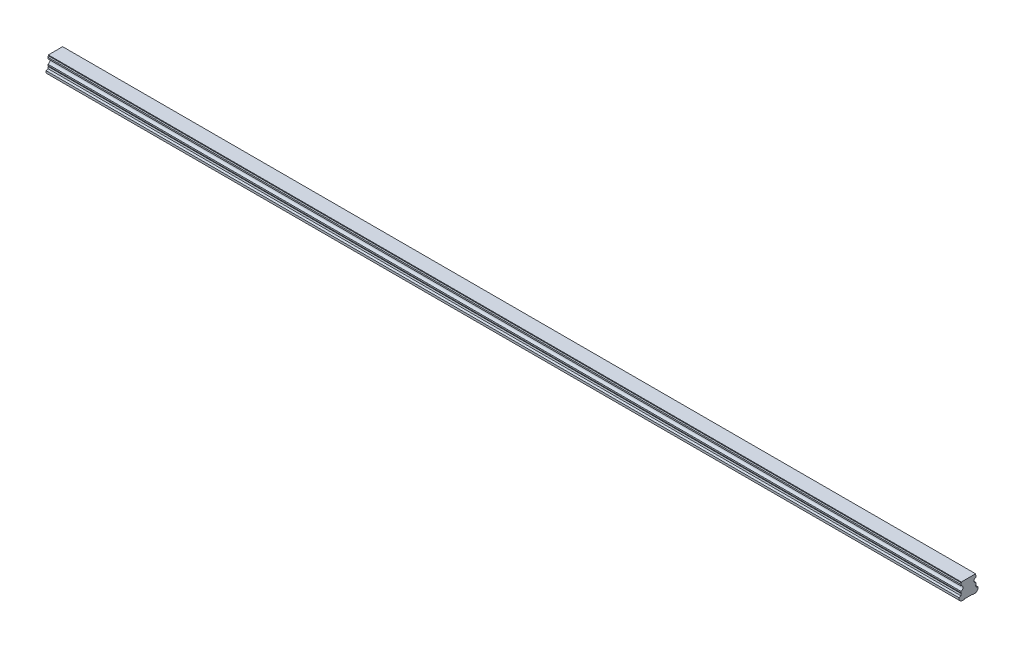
ISO-10303-21;
HEADER;
FILE_DESCRIPTION(('STEP AP214'),'2;1');
FILE_NAME('part.step','',(''),(''),'','','');
FILE_SCHEMA(('AUTOMOTIVE_DESIGN { 1 0 10303 214 1 1 1 1 }'));
ENDSEC;
DATA;
#1=APPLICATION_CONTEXT('core data for automotive mechanical design processes');
#2=APPLICATION_PROTOCOL_DEFINITION('international standard','automotive_design',2000,#1);
#3=PRODUCT_CONTEXT('',#1,'mechanical');
#4=PRODUCT('Part','Part','',(#3));
#5=PRODUCT_RELATED_PRODUCT_CATEGORY('part','',(#4));
#6=PRODUCT_DEFINITION_FORMATION('','',#4);
#7=PRODUCT_DEFINITION_CONTEXT('part definition',#1,'design');
#8=PRODUCT_DEFINITION('design','',#6,#7);
#9=PRODUCT_DEFINITION_SHAPE('','',#8);
#10=(LENGTH_UNIT() NAMED_UNIT(*) SI_UNIT(.MILLI.,.METRE.));
#11=(NAMED_UNIT(*) PLANE_ANGLE_UNIT() SI_UNIT($,.RADIAN.));
#12=(NAMED_UNIT(*) SI_UNIT($,.STERADIAN.) SOLID_ANGLE_UNIT());
#13=UNCERTAINTY_MEASURE_WITH_UNIT(LENGTH_MEASURE(1.E-05),#10,'distance_accuracy_value','');
#14=(GEOMETRIC_REPRESENTATION_CONTEXT(3) GLOBAL_UNCERTAINTY_ASSIGNED_CONTEXT((#13)) GLOBAL_UNIT_ASSIGNED_CONTEXT((#10,
#11,#12)) REPRESENTATION_CONTEXT('',''));
#15=CARTESIAN_POINT('',(0.,0.,0.));
#16=DIRECTION('',(0.,0.,1.));
#17=DIRECTION('',(1.,0.,0.));
#18=AXIS2_PLACEMENT_3D('',#15,#16,#17);
#19=CARTESIAN_POINT('',(1170.,0.499999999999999,0.));
#20=DIRECTION('',(0.,-1.,0.));
#21=DIRECTION('',(0.,0.,-1.));
#22=AXIS2_PLACEMENT_3D('',#19,#20,#21);
#23=CONICAL_SURFACE('',#22,3.5,0.785398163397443);
#24=CARTESIAN_POINT('',(1170.,1.00000000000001,0.));
#25=DIRECTION('',(0.,1.,0.));
#26=DIRECTION('',(0.,0.,1.));
#27=AXIS2_PLACEMENT_3D('',#24,#25,#26);
#28=CIRCLE('',#27,3.);
#29=CARTESIAN_POINT('',(1170.,1.00000000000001,3.));
#30=VERTEX_POINT('',#29);
#31=EDGE_CURVE('E11',#30,#30,#28,.F.);
#32=ORIENTED_EDGE('',*,*,#31,.F.);
#33=EDGE_LOOP('',(#32));
#34=FACE_BOUND('',#33,.T.);
#35=CARTESIAN_POINT('',(1170.,0.499999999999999,0.));
#36=DIRECTION('',(0.,1.,0.));
#37=DIRECTION('',(0.,0.,1.));
#38=AXIS2_PLACEMENT_3D('',#35,#36,#37);
#39=CIRCLE('',#38,3.5);
#40=CARTESIAN_POINT('',(1170.,0.5,3.5));
#41=VERTEX_POINT('',#40);
#42=EDGE_CURVE('E638',#41,#41,#39,.T.);
#43=ORIENTED_EDGE('',*,*,#42,.F.);
#44=EDGE_LOOP('',(#43));
#45=FACE_BOUND('',#44,.T.);
#46=ADVANCED_FACE('F39',(#34,#45),#23,.F.);
#47=CARTESIAN_POINT('',(1170.,12.,0.));
#48=DIRECTION('',(0.,-1.,0.));
#49=DIRECTION('',(0.,0.,-1.));
#50=AXIS2_PLACEMENT_3D('',#47,#48,#49);
#51=CYLINDRICAL_SURFACE('',#50,3.);
#52=ORIENTED_EDGE('',*,*,#31,.T.);
#53=EDGE_LOOP('',(#52));
#54=FACE_BOUND('',#53,.T.);
#55=CARTESIAN_POINT('',(1170.,12.,0.));
#56=DIRECTION('',(0.,-1.,0.));
#57=DIRECTION('',(0.,0.,-1.));
#58=AXIS2_PLACEMENT_3D('',#55,#56,#57);
#59=CIRCLE('',#58,3.);
#60=CARTESIAN_POINT('',(1170.,12.,-3.));
#61=VERTEX_POINT('',#60);
#62=EDGE_CURVE('E49',#61,#61,#59,.T.);
#63=ORIENTED_EDGE('',*,*,#62,.F.);
#64=EDGE_LOOP('',(#63));
#65=FACE_BOUND('',#64,.T.);
#66=ADVANCED_FACE('F889',(#54,#65),#51,.F.);
#67=CARTESIAN_POINT('',(1170.,12.,0.));
#68=DIRECTION('',(0.,-1.,0.));
#69=DIRECTION('',(0.,0.,-1.));
#70=AXIS2_PLACEMENT_3D('',#67,#68,#69);
#71=PLANE('',#70);
#72=CARTESIAN_POINT('',(1170.,12.,0.));
#73=DIRECTION('',(0.,-1.,0.));
#74=DIRECTION('',(0.,0.,-1.));
#75=AXIS2_PLACEMENT_3D('',#72,#73,#74);
#76=CIRCLE('',#75,2.5);
#77=CARTESIAN_POINT('',(1170.,12.,-2.5));
#78=VERTEX_POINT('',#77);
#79=EDGE_CURVE('E42',#78,#78,#76,.T.);
#80=ORIENTED_EDGE('',*,*,#79,.F.);
#81=EDGE_LOOP('',(#80));
#82=FACE_BOUND('',#81,.T.);
#83=ORIENTED_EDGE('',*,*,#62,.T.);
#84=EDGE_LOOP('',(#83));
#85=FACE_BOUND('',#84,.T.);
#86=ADVANCED_FACE('F894',(#82,#85),#71,.T.);
#87=CARTESIAN_POINT('',(1110.,0.499999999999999,0.));
#88=DIRECTION('',(0.,-1.,0.));
#89=DIRECTION('',(0.,0.,-1.));
#90=AXIS2_PLACEMENT_3D('',#87,#88,#89);
#91=CONICAL_SURFACE('',#90,3.5,0.785398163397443);
#92=CARTESIAN_POINT('',(1110.,1.00000000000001,0.));
#93=DIRECTION('',(0.,1.,0.));
#94=DIRECTION('',(0.,0.,1.));
#95=AXIS2_PLACEMENT_3D('',#92,#93,#94);
#96=CIRCLE('',#95,3.);
#97=CARTESIAN_POINT('',(1110.,1.00000000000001,3.));
#98=VERTEX_POINT('',#97);
#99=EDGE_CURVE('E634',#98,#98,#96,.F.);
#100=ORIENTED_EDGE('',*,*,#99,.F.);
#101=EDGE_LOOP('',(#100));
#102=FACE_BOUND('',#101,.T.);
#103=CARTESIAN_POINT('',(1110.,0.499999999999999,0.));
#104=DIRECTION('',(0.,1.,0.));
#105=DIRECTION('',(0.,0.,1.));
#106=AXIS2_PLACEMENT_3D('',#103,#104,#105);
#107=CIRCLE('',#106,3.5);
#108=CARTESIAN_POINT('',(1110.,0.5,3.5));
#109=VERTEX_POINT('',#108);
#110=EDGE_CURVE('E626',#109,#109,#107,.T.);
#111=ORIENTED_EDGE('',*,*,#110,.F.);
#112=EDGE_LOOP('',(#111));
#113=FACE_BOUND('',#112,.T.);
#114=ADVANCED_FACE('F1173',(#102,#113),#91,.F.);
#115=CARTESIAN_POINT('',(1110.,12.,0.));
#116=DIRECTION('',(0.,-1.,0.));
#117=DIRECTION('',(0.,0.,-1.));
#118=AXIS2_PLACEMENT_3D('',#115,#116,#117);
#119=CYLINDRICAL_SURFACE('',#118,3.);
#120=ORIENTED_EDGE('',*,*,#99,.T.);
#121=EDGE_LOOP('',(#120));
#122=FACE_BOUND('',#121,.T.);
#123=CARTESIAN_POINT('',(1110.,12.,0.));
#124=DIRECTION('',(0.,-1.,0.));
#125=DIRECTION('',(0.,0.,-1.));
#126=AXIS2_PLACEMENT_3D('',#123,#124,#125);
#127=CIRCLE('',#126,3.);
#128=CARTESIAN_POINT('',(1110.,12.,-3.));
#129=VERTEX_POINT('',#128);
#130=EDGE_CURVE('E630',#129,#129,#127,.T.);
#131=ORIENTED_EDGE('',*,*,#130,.F.);
#132=EDGE_LOOP('',(#131));
#133=FACE_BOUND('',#132,.T.);
#134=ADVANCED_FACE('F1169',(#122,#133),#119,.F.);
#135=CARTESIAN_POINT('',(1110.,12.,0.));
#136=DIRECTION('',(0.,-1.,0.));
#137=DIRECTION('',(0.,0.,-1.));
#138=AXIS2_PLACEMENT_3D('',#135,#136,#137);
#139=PLANE('',#138);
#140=CARTESIAN_POINT('',(1110.,12.,0.));
#141=DIRECTION('',(0.,-1.,0.));
#142=DIRECTION('',(0.,0.,-1.));
#143=AXIS2_PLACEMENT_3D('',#140,#141,#142);
#144=CIRCLE('',#143,2.5);
#145=CARTESIAN_POINT('',(1110.,12.,-2.5));
#146=VERTEX_POINT('',#145);
#147=EDGE_CURVE('E713',#146,#146,#144,.T.);
#148=ORIENTED_EDGE('',*,*,#147,.F.);
#149=EDGE_LOOP('',(#148));
#150=FACE_BOUND('',#149,.T.);
#151=ORIENTED_EDGE('',*,*,#130,.T.);
#152=EDGE_LOOP('',(#151));
#153=FACE_BOUND('',#152,.T.);
#154=ADVANCED_FACE('F1165',(#150,#153),#139,.T.);
#155=CARTESIAN_POINT('',(1050.,0.499999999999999,0.));
#156=DIRECTION('',(0.,-1.,0.));
#157=DIRECTION('',(0.,0.,-1.));
#158=AXIS2_PLACEMENT_3D('',#155,#156,#157);
#159=CONICAL_SURFACE('',#158,3.5,0.785398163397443);
#160=CARTESIAN_POINT('',(1050.,1.00000000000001,0.));
#161=DIRECTION('',(0.,1.,0.));
#162=DIRECTION('',(0.,0.,1.));
#163=AXIS2_PLACEMENT_3D('',#160,#161,#162);
#164=CIRCLE('',#163,3.);
#165=CARTESIAN_POINT('',(1050.,1.00000000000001,3.));
#166=VERTEX_POINT('',#165);
#167=EDGE_CURVE('E622',#166,#166,#164,.F.);
#168=ORIENTED_EDGE('',*,*,#167,.F.);
#169=EDGE_LOOP('',(#168));
#170=FACE_BOUND('',#169,.T.);
#171=CARTESIAN_POINT('',(1050.,0.499999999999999,0.));
#172=DIRECTION('',(0.,1.,0.));
#173=DIRECTION('',(0.,0.,1.));
#174=AXIS2_PLACEMENT_3D('',#171,#172,#173);
#175=CIRCLE('',#174,3.5);
#176=CARTESIAN_POINT('',(1050.,0.5,3.5));
#177=VERTEX_POINT('',#176);
#178=EDGE_CURVE('E614',#177,#177,#175,.T.);
#179=ORIENTED_EDGE('',*,*,#178,.F.);
#180=EDGE_LOOP('',(#179));
#181=FACE_BOUND('',#180,.T.);
#182=ADVANCED_FACE('F1161',(#170,#181),#159,.F.);
#183=CARTESIAN_POINT('',(1050.,12.,0.));
#184=DIRECTION('',(0.,-1.,0.));
#185=DIRECTION('',(0.,0.,-1.));
#186=AXIS2_PLACEMENT_3D('',#183,#184,#185);
#187=CYLINDRICAL_SURFACE('',#186,3.);
#188=ORIENTED_EDGE('',*,*,#167,.T.);
#189=EDGE_LOOP('',(#188));
#190=FACE_BOUND('',#189,.T.);
#191=CARTESIAN_POINT('',(1050.,12.,0.));
#192=DIRECTION('',(0.,-1.,0.));
#193=DIRECTION('',(0.,0.,-1.));
#194=AXIS2_PLACEMENT_3D('',#191,#192,#193);
#195=CIRCLE('',#194,3.);
#196=CARTESIAN_POINT('',(1050.,12.,-3.));
#197=VERTEX_POINT('',#196);
#198=EDGE_CURVE('E618',#197,#197,#195,.T.);
#199=ORIENTED_EDGE('',*,*,#198,.F.);
#200=EDGE_LOOP('',(#199));
#201=FACE_BOUND('',#200,.T.);
#202=ADVANCED_FACE('F1157',(#190,#201),#187,.F.);
#203=CARTESIAN_POINT('',(1050.,12.,0.));
#204=DIRECTION('',(0.,-1.,0.));
#205=DIRECTION('',(0.,0.,-1.));
#206=AXIS2_PLACEMENT_3D('',#203,#204,#205);
#207=PLANE('',#206);
#208=CARTESIAN_POINT('',(1050.,12.,0.));
#209=DIRECTION('',(0.,-1.,0.));
#210=DIRECTION('',(0.,0.,-1.));
#211=AXIS2_PLACEMENT_3D('',#208,#209,#210);
#212=CIRCLE('',#211,2.5);
#213=CARTESIAN_POINT('',(1050.,12.,-2.5));
#214=VERTEX_POINT('',#213);
#215=EDGE_CURVE('E710',#214,#214,#212,.T.);
#216=ORIENTED_EDGE('',*,*,#215,.F.);
#217=EDGE_LOOP('',(#216));
#218=FACE_BOUND('',#217,.T.);
#219=ORIENTED_EDGE('',*,*,#198,.T.);
#220=EDGE_LOOP('',(#219));
#221=FACE_BOUND('',#220,.T.);
#222=ADVANCED_FACE('F1153',(#218,#221),#207,.T.);
#223=CARTESIAN_POINT('',(990.,0.499999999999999,0.));
#224=DIRECTION('',(0.,-1.,0.));
#225=DIRECTION('',(0.,0.,-1.));
#226=AXIS2_PLACEMENT_3D('',#223,#224,#225);
#227=CONICAL_SURFACE('',#226,3.5,0.785398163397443);
#228=CARTESIAN_POINT('',(990.,1.00000000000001,0.));
#229=DIRECTION('',(0.,1.,0.));
#230=DIRECTION('',(0.,0.,1.));
#231=AXIS2_PLACEMENT_3D('',#228,#229,#230);
#232=CIRCLE('',#231,3.);
#233=CARTESIAN_POINT('',(990.,1.00000000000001,3.));
#234=VERTEX_POINT('',#233);
#235=EDGE_CURVE('E610',#234,#234,#232,.F.);
#236=ORIENTED_EDGE('',*,*,#235,.F.);
#237=EDGE_LOOP('',(#236));
#238=FACE_BOUND('',#237,.T.);
#239=CARTESIAN_POINT('',(990.,0.499999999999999,0.));
#240=DIRECTION('',(0.,1.,0.));
#241=DIRECTION('',(0.,0.,1.));
#242=AXIS2_PLACEMENT_3D('',#239,#240,#241);
#243=CIRCLE('',#242,3.5);
#244=CARTESIAN_POINT('',(990.,0.5,3.5));
#245=VERTEX_POINT('',#244);
#246=EDGE_CURVE('E602',#245,#245,#243,.T.);
#247=ORIENTED_EDGE('',*,*,#246,.F.);
#248=EDGE_LOOP('',(#247));
#249=FACE_BOUND('',#248,.T.);
#250=ADVANCED_FACE('F1149',(#238,#249),#227,.F.);
#251=CARTESIAN_POINT('',(990.,12.,0.));
#252=DIRECTION('',(0.,-1.,0.));
#253=DIRECTION('',(0.,0.,-1.));
#254=AXIS2_PLACEMENT_3D('',#251,#252,#253);
#255=CYLINDRICAL_SURFACE('',#254,3.);
#256=ORIENTED_EDGE('',*,*,#235,.T.);
#257=EDGE_LOOP('',(#256));
#258=FACE_BOUND('',#257,.T.);
#259=CARTESIAN_POINT('',(990.,12.,0.));
#260=DIRECTION('',(0.,-1.,0.));
#261=DIRECTION('',(0.,0.,-1.));
#262=AXIS2_PLACEMENT_3D('',#259,#260,#261);
#263=CIRCLE('',#262,3.);
#264=CARTESIAN_POINT('',(990.,12.,-3.));
#265=VERTEX_POINT('',#264);
#266=EDGE_CURVE('E606',#265,#265,#263,.T.);
#267=ORIENTED_EDGE('',*,*,#266,.F.);
#268=EDGE_LOOP('',(#267));
#269=FACE_BOUND('',#268,.T.);
#270=ADVANCED_FACE('F1145',(#258,#269),#255,.F.);
#271=CARTESIAN_POINT('',(990.,12.,0.));
#272=DIRECTION('',(0.,-1.,0.));
#273=DIRECTION('',(0.,0.,-1.));
#274=AXIS2_PLACEMENT_3D('',#271,#272,#273);
#275=PLANE('',#274);
#276=CARTESIAN_POINT('',(990.,12.,0.));
#277=DIRECTION('',(0.,-1.,0.));
#278=DIRECTION('',(0.,0.,-1.));
#279=AXIS2_PLACEMENT_3D('',#276,#277,#278);
#280=CIRCLE('',#279,2.5);
#281=CARTESIAN_POINT('',(990.,12.,-2.5));
#282=VERTEX_POINT('',#281);
#283=EDGE_CURVE('E706',#282,#282,#280,.T.);
#284=ORIENTED_EDGE('',*,*,#283,.F.);
#285=EDGE_LOOP('',(#284));
#286=FACE_BOUND('',#285,.T.);
#287=ORIENTED_EDGE('',*,*,#266,.T.);
#288=EDGE_LOOP('',(#287));
#289=FACE_BOUND('',#288,.T.);
#290=ADVANCED_FACE('F1141',(#286,#289),#275,.T.);
#291=CARTESIAN_POINT('',(930.,0.499999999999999,0.));
#292=DIRECTION('',(0.,-1.,0.));
#293=DIRECTION('',(0.,0.,-1.));
#294=AXIS2_PLACEMENT_3D('',#291,#292,#293);
#295=CONICAL_SURFACE('',#294,3.5,0.785398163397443);
#296=CARTESIAN_POINT('',(930.,1.00000000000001,0.));
#297=DIRECTION('',(0.,1.,0.));
#298=DIRECTION('',(0.,0.,1.));
#299=AXIS2_PLACEMENT_3D('',#296,#297,#298);
#300=CIRCLE('',#299,3.);
#301=CARTESIAN_POINT('',(930.,1.00000000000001,3.));
#302=VERTEX_POINT('',#301);
#303=EDGE_CURVE('E598',#302,#302,#300,.F.);
#304=ORIENTED_EDGE('',*,*,#303,.F.);
#305=EDGE_LOOP('',(#304));
#306=FACE_BOUND('',#305,.T.);
#307=CARTESIAN_POINT('',(930.,0.499999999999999,0.));
#308=DIRECTION('',(0.,1.,0.));
#309=DIRECTION('',(0.,0.,1.));
#310=AXIS2_PLACEMENT_3D('',#307,#308,#309);
#311=CIRCLE('',#310,3.5);
#312=CARTESIAN_POINT('',(930.,0.5,3.5));
#313=VERTEX_POINT('',#312);
#314=EDGE_CURVE('E590',#313,#313,#311,.T.);
#315=ORIENTED_EDGE('',*,*,#314,.F.);
#316=EDGE_LOOP('',(#315));
#317=FACE_BOUND('',#316,.T.);
#318=ADVANCED_FACE('F1137',(#306,#317),#295,.F.);
#319=CARTESIAN_POINT('',(930.,12.,0.));
#320=DIRECTION('',(0.,-1.,0.));
#321=DIRECTION('',(0.,0.,-1.));
#322=AXIS2_PLACEMENT_3D('',#319,#320,#321);
#323=CYLINDRICAL_SURFACE('',#322,3.);
#324=ORIENTED_EDGE('',*,*,#303,.T.);
#325=EDGE_LOOP('',(#324));
#326=FACE_BOUND('',#325,.T.);
#327=CARTESIAN_POINT('',(930.,12.,0.));
#328=DIRECTION('',(0.,-1.,0.));
#329=DIRECTION('',(0.,0.,-1.));
#330=AXIS2_PLACEMENT_3D('',#327,#328,#329);
#331=CIRCLE('',#330,3.);
#332=CARTESIAN_POINT('',(930.,12.,-3.));
#333=VERTEX_POINT('',#332);
#334=EDGE_CURVE('E594',#333,#333,#331,.T.);
#335=ORIENTED_EDGE('',*,*,#334,.F.);
#336=EDGE_LOOP('',(#335));
#337=FACE_BOUND('',#336,.T.);
#338=ADVANCED_FACE('F1133',(#326,#337),#323,.F.);
#339=CARTESIAN_POINT('',(930.,12.,0.));
#340=DIRECTION('',(0.,-1.,0.));
#341=DIRECTION('',(0.,0.,-1.));
#342=AXIS2_PLACEMENT_3D('',#339,#340,#341);
#343=PLANE('',#342);
#344=CARTESIAN_POINT('',(930.,12.,0.));
#345=DIRECTION('',(0.,-1.,0.));
#346=DIRECTION('',(0.,0.,-1.));
#347=AXIS2_PLACEMENT_3D('',#344,#345,#346);
#348=CIRCLE('',#347,2.5);
#349=CARTESIAN_POINT('',(930.,12.,-2.5));
#350=VERTEX_POINT('',#349);
#351=EDGE_CURVE('E702',#350,#350,#348,.T.);
#352=ORIENTED_EDGE('',*,*,#351,.F.);
#353=EDGE_LOOP('',(#352));
#354=FACE_BOUND('',#353,.T.);
#355=ORIENTED_EDGE('',*,*,#334,.T.);
#356=EDGE_LOOP('',(#355));
#357=FACE_BOUND('',#356,.T.);
#358=ADVANCED_FACE('F1129',(#354,#357),#343,.T.);
#359=CARTESIAN_POINT('',(870.,0.499999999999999,0.));
#360=DIRECTION('',(0.,-1.,0.));
#361=DIRECTION('',(0.,0.,-1.));
#362=AXIS2_PLACEMENT_3D('',#359,#360,#361);
#363=CONICAL_SURFACE('',#362,3.5,0.785398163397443);
#364=CARTESIAN_POINT('',(870.,1.00000000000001,0.));
#365=DIRECTION('',(0.,1.,0.));
#366=DIRECTION('',(0.,0.,1.));
#367=AXIS2_PLACEMENT_3D('',#364,#365,#366);
#368=CIRCLE('',#367,3.);
#369=CARTESIAN_POINT('',(870.,1.00000000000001,3.));
#370=VERTEX_POINT('',#369);
#371=EDGE_CURVE('E586',#370,#370,#368,.F.);
#372=ORIENTED_EDGE('',*,*,#371,.F.);
#373=EDGE_LOOP('',(#372));
#374=FACE_BOUND('',#373,.T.);
#375=CARTESIAN_POINT('',(870.,0.499999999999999,0.));
#376=DIRECTION('',(0.,1.,0.));
#377=DIRECTION('',(0.,0.,1.));
#378=AXIS2_PLACEMENT_3D('',#375,#376,#377);
#379=CIRCLE('',#378,3.5);
#380=CARTESIAN_POINT('',(870.,0.5,3.5));
#381=VERTEX_POINT('',#380);
#382=EDGE_CURVE('E578',#381,#381,#379,.T.);
#383=ORIENTED_EDGE('',*,*,#382,.F.);
#384=EDGE_LOOP('',(#383));
#385=FACE_BOUND('',#384,.T.);
#386=ADVANCED_FACE('F1125',(#374,#385),#363,.F.);
#387=CARTESIAN_POINT('',(870.,12.,0.));
#388=DIRECTION('',(0.,-1.,0.));
#389=DIRECTION('',(0.,0.,-1.));
#390=AXIS2_PLACEMENT_3D('',#387,#388,#389);
#391=CYLINDRICAL_SURFACE('',#390,3.);
#392=ORIENTED_EDGE('',*,*,#371,.T.);
#393=EDGE_LOOP('',(#392));
#394=FACE_BOUND('',#393,.T.);
#395=CARTESIAN_POINT('',(870.,12.,0.));
#396=DIRECTION('',(0.,-1.,0.));
#397=DIRECTION('',(0.,0.,-1.));
#398=AXIS2_PLACEMENT_3D('',#395,#396,#397);
#399=CIRCLE('',#398,3.);
#400=CARTESIAN_POINT('',(870.,12.,-3.));
#401=VERTEX_POINT('',#400);
#402=EDGE_CURVE('E582',#401,#401,#399,.T.);
#403=ORIENTED_EDGE('',*,*,#402,.F.);
#404=EDGE_LOOP('',(#403));
#405=FACE_BOUND('',#404,.T.);
#406=ADVANCED_FACE('F1121',(#394,#405),#391,.F.);
#407=CARTESIAN_POINT('',(870.,12.,0.));
#408=DIRECTION('',(0.,-1.,0.));
#409=DIRECTION('',(0.,0.,-1.));
#410=AXIS2_PLACEMENT_3D('',#407,#408,#409);
#411=PLANE('',#410);
#412=CARTESIAN_POINT('',(870.,12.,0.));
#413=DIRECTION('',(0.,-1.,0.));
#414=DIRECTION('',(0.,0.,-1.));
#415=AXIS2_PLACEMENT_3D('',#412,#413,#414);
#416=CIRCLE('',#415,2.5);
#417=CARTESIAN_POINT('',(870.,12.,-2.5));
#418=VERTEX_POINT('',#417);
#419=EDGE_CURVE('E698',#418,#418,#416,.T.);
#420=ORIENTED_EDGE('',*,*,#419,.F.);
#421=EDGE_LOOP('',(#420));
#422=FACE_BOUND('',#421,.T.);
#423=ORIENTED_EDGE('',*,*,#402,.T.);
#424=EDGE_LOOP('',(#423));
#425=FACE_BOUND('',#424,.T.);
#426=ADVANCED_FACE('F1117',(#422,#425),#411,.T.);
#427=CARTESIAN_POINT('',(810.,0.499999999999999,0.));
#428=DIRECTION('',(0.,-1.,0.));
#429=DIRECTION('',(0.,0.,-1.));
#430=AXIS2_PLACEMENT_3D('',#427,#428,#429);
#431=CONICAL_SURFACE('',#430,3.5,0.785398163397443);
#432=CARTESIAN_POINT('',(810.,1.00000000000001,0.));
#433=DIRECTION('',(0.,1.,0.));
#434=DIRECTION('',(0.,0.,1.));
#435=AXIS2_PLACEMENT_3D('',#432,#433,#434);
#436=CIRCLE('',#435,3.);
#437=CARTESIAN_POINT('',(810.,1.00000000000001,3.));
#438=VERTEX_POINT('',#437);
#439=EDGE_CURVE('E574',#438,#438,#436,.F.);
#440=ORIENTED_EDGE('',*,*,#439,.F.);
#441=EDGE_LOOP('',(#440));
#442=FACE_BOUND('',#441,.T.);
#443=CARTESIAN_POINT('',(810.,0.499999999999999,0.));
#444=DIRECTION('',(0.,1.,0.));
#445=DIRECTION('',(0.,0.,1.));
#446=AXIS2_PLACEMENT_3D('',#443,#444,#445);
#447=CIRCLE('',#446,3.5);
#448=CARTESIAN_POINT('',(810.,0.5,3.5));
#449=VERTEX_POINT('',#448);
#450=EDGE_CURVE('E566',#449,#449,#447,.T.);
#451=ORIENTED_EDGE('',*,*,#450,.F.);
#452=EDGE_LOOP('',(#451));
#453=FACE_BOUND('',#452,.T.);
#454=ADVANCED_FACE('F1113',(#442,#453),#431,.F.);
#455=CARTESIAN_POINT('',(810.,12.,0.));
#456=DIRECTION('',(0.,-1.,0.));
#457=DIRECTION('',(0.,0.,-1.));
#458=AXIS2_PLACEMENT_3D('',#455,#456,#457);
#459=CYLINDRICAL_SURFACE('',#458,3.);
#460=ORIENTED_EDGE('',*,*,#439,.T.);
#461=EDGE_LOOP('',(#460));
#462=FACE_BOUND('',#461,.T.);
#463=CARTESIAN_POINT('',(810.,12.,0.));
#464=DIRECTION('',(0.,-1.,0.));
#465=DIRECTION('',(0.,0.,-1.));
#466=AXIS2_PLACEMENT_3D('',#463,#464,#465);
#467=CIRCLE('',#466,3.);
#468=CARTESIAN_POINT('',(810.,12.,-3.));
#469=VERTEX_POINT('',#468);
#470=EDGE_CURVE('E570',#469,#469,#467,.T.);
#471=ORIENTED_EDGE('',*,*,#470,.F.);
#472=EDGE_LOOP('',(#471));
#473=FACE_BOUND('',#472,.T.);
#474=ADVANCED_FACE('F1109',(#462,#473),#459,.F.);
#475=CARTESIAN_POINT('',(810.,12.,0.));
#476=DIRECTION('',(0.,-1.,0.));
#477=DIRECTION('',(0.,0.,-1.));
#478=AXIS2_PLACEMENT_3D('',#475,#476,#477);
#479=PLANE('',#478);
#480=CARTESIAN_POINT('',(810.,12.,0.));
#481=DIRECTION('',(0.,-1.,0.));
#482=DIRECTION('',(0.,0.,-1.));
#483=AXIS2_PLACEMENT_3D('',#480,#481,#482);
#484=CIRCLE('',#483,2.5);
#485=CARTESIAN_POINT('',(810.,12.,-2.5));
#486=VERTEX_POINT('',#485);
#487=EDGE_CURVE('E694',#486,#486,#484,.T.);
#488=ORIENTED_EDGE('',*,*,#487,.F.);
#489=EDGE_LOOP('',(#488));
#490=FACE_BOUND('',#489,.T.);
#491=ORIENTED_EDGE('',*,*,#470,.T.);
#492=EDGE_LOOP('',(#491));
#493=FACE_BOUND('',#492,.T.);
#494=ADVANCED_FACE('F1105',(#490,#493),#479,.T.);
#495=CARTESIAN_POINT('',(750.,0.499999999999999,0.));
#496=DIRECTION('',(0.,-1.,0.));
#497=DIRECTION('',(0.,0.,-1.));
#498=AXIS2_PLACEMENT_3D('',#495,#496,#497);
#499=CONICAL_SURFACE('',#498,3.5,0.785398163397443);
#500=CARTESIAN_POINT('',(750.,1.00000000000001,0.));
#501=DIRECTION('',(0.,1.,0.));
#502=DIRECTION('',(0.,0.,1.));
#503=AXIS2_PLACEMENT_3D('',#500,#501,#502);
#504=CIRCLE('',#503,3.);
#505=CARTESIAN_POINT('',(750.,1.00000000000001,3.));
#506=VERTEX_POINT('',#505);
#507=EDGE_CURVE('E562',#506,#506,#504,.F.);
#508=ORIENTED_EDGE('',*,*,#507,.F.);
#509=EDGE_LOOP('',(#508));
#510=FACE_BOUND('',#509,.T.);
#511=CARTESIAN_POINT('',(750.,0.499999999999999,0.));
#512=DIRECTION('',(0.,1.,0.));
#513=DIRECTION('',(0.,0.,1.));
#514=AXIS2_PLACEMENT_3D('',#511,#512,#513);
#515=CIRCLE('',#514,3.5);
#516=CARTESIAN_POINT('',(750.,0.5,3.5));
#517=VERTEX_POINT('',#516);
#518=EDGE_CURVE('E554',#517,#517,#515,.T.);
#519=ORIENTED_EDGE('',*,*,#518,.F.);
#520=EDGE_LOOP('',(#519));
#521=FACE_BOUND('',#520,.T.);
#522=ADVANCED_FACE('F1101',(#510,#521),#499,.F.);
#523=CARTESIAN_POINT('',(750.,12.,0.));
#524=DIRECTION('',(0.,-1.,0.));
#525=DIRECTION('',(0.,0.,-1.));
#526=AXIS2_PLACEMENT_3D('',#523,#524,#525);
#527=CYLINDRICAL_SURFACE('',#526,3.);
#528=ORIENTED_EDGE('',*,*,#507,.T.);
#529=EDGE_LOOP('',(#528));
#530=FACE_BOUND('',#529,.T.);
#531=CARTESIAN_POINT('',(750.,12.,0.));
#532=DIRECTION('',(0.,-1.,0.));
#533=DIRECTION('',(0.,0.,-1.));
#534=AXIS2_PLACEMENT_3D('',#531,#532,#533);
#535=CIRCLE('',#534,3.);
#536=CARTESIAN_POINT('',(750.,12.,-3.));
#537=VERTEX_POINT('',#536);
#538=EDGE_CURVE('E558',#537,#537,#535,.T.);
#539=ORIENTED_EDGE('',*,*,#538,.F.);
#540=EDGE_LOOP('',(#539));
#541=FACE_BOUND('',#540,.T.);
#542=ADVANCED_FACE('F1097',(#530,#541),#527,.F.);
#543=CARTESIAN_POINT('',(750.,12.,0.));
#544=DIRECTION('',(0.,-1.,0.));
#545=DIRECTION('',(0.,0.,-1.));
#546=AXIS2_PLACEMENT_3D('',#543,#544,#545);
#547=PLANE('',#546);
#548=CARTESIAN_POINT('',(750.,12.,0.));
#549=DIRECTION('',(0.,-1.,0.));
#550=DIRECTION('',(0.,0.,-1.));
#551=AXIS2_PLACEMENT_3D('',#548,#549,#550);
#552=CIRCLE('',#551,2.5);
#553=CARTESIAN_POINT('',(750.,12.,-2.5));
#554=VERTEX_POINT('',#553);
#555=EDGE_CURVE('E690',#554,#554,#552,.T.);
#556=ORIENTED_EDGE('',*,*,#555,.F.);
#557=EDGE_LOOP('',(#556));
#558=FACE_BOUND('',#557,.T.);
#559=ORIENTED_EDGE('',*,*,#538,.T.);
#560=EDGE_LOOP('',(#559));
#561=FACE_BOUND('',#560,.T.);
#562=ADVANCED_FACE('F1093',(#558,#561),#547,.T.);
#563=CARTESIAN_POINT('',(690.,0.499999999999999,0.));
#564=DIRECTION('',(0.,-1.,0.));
#565=DIRECTION('',(0.,0.,-1.));
#566=AXIS2_PLACEMENT_3D('',#563,#564,#565);
#567=CONICAL_SURFACE('',#566,3.5,0.785398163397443);
#568=CARTESIAN_POINT('',(690.,1.00000000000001,0.));
#569=DIRECTION('',(0.,1.,0.));
#570=DIRECTION('',(0.,0.,1.));
#571=AXIS2_PLACEMENT_3D('',#568,#569,#570);
#572=CIRCLE('',#571,3.);
#573=CARTESIAN_POINT('',(690.,1.00000000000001,3.));
#574=VERTEX_POINT('',#573);
#575=EDGE_CURVE('E550',#574,#574,#572,.F.);
#576=ORIENTED_EDGE('',*,*,#575,.F.);
#577=EDGE_LOOP('',(#576));
#578=FACE_BOUND('',#577,.T.);
#579=CARTESIAN_POINT('',(690.,0.499999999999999,0.));
#580=DIRECTION('',(0.,1.,0.));
#581=DIRECTION('',(0.,0.,1.));
#582=AXIS2_PLACEMENT_3D('',#579,#580,#581);
#583=CIRCLE('',#582,3.5);
#584=CARTESIAN_POINT('',(690.,0.5,3.5));
#585=VERTEX_POINT('',#584);
#586=EDGE_CURVE('E542',#585,#585,#583,.T.);
#587=ORIENTED_EDGE('',*,*,#586,.F.);
#588=EDGE_LOOP('',(#587));
#589=FACE_BOUND('',#588,.T.);
#590=ADVANCED_FACE('F1089',(#578,#589),#567,.F.);
#591=CARTESIAN_POINT('',(690.,12.,0.));
#592=DIRECTION('',(0.,-1.,0.));
#593=DIRECTION('',(0.,0.,-1.));
#594=AXIS2_PLACEMENT_3D('',#591,#592,#593);
#595=CYLINDRICAL_SURFACE('',#594,3.);
#596=ORIENTED_EDGE('',*,*,#575,.T.);
#597=EDGE_LOOP('',(#596));
#598=FACE_BOUND('',#597,.T.);
#599=CARTESIAN_POINT('',(690.,12.,0.));
#600=DIRECTION('',(0.,-1.,0.));
#601=DIRECTION('',(0.,0.,-1.));
#602=AXIS2_PLACEMENT_3D('',#599,#600,#601);
#603=CIRCLE('',#602,3.);
#604=CARTESIAN_POINT('',(690.,12.,-3.));
#605=VERTEX_POINT('',#604);
#606=EDGE_CURVE('E546',#605,#605,#603,.T.);
#607=ORIENTED_EDGE('',*,*,#606,.F.);
#608=EDGE_LOOP('',(#607));
#609=FACE_BOUND('',#608,.T.);
#610=ADVANCED_FACE('F1085',(#598,#609),#595,.F.);
#611=CARTESIAN_POINT('',(690.,12.,0.));
#612=DIRECTION('',(0.,-1.,0.));
#613=DIRECTION('',(0.,0.,-1.));
#614=AXIS2_PLACEMENT_3D('',#611,#612,#613);
#615=PLANE('',#614);
#616=CARTESIAN_POINT('',(690.,12.,0.));
#617=DIRECTION('',(0.,-1.,0.));
#618=DIRECTION('',(0.,0.,-1.));
#619=AXIS2_PLACEMENT_3D('',#616,#617,#618);
#620=CIRCLE('',#619,2.5);
#621=CARTESIAN_POINT('',(690.,12.,-2.5));
#622=VERTEX_POINT('',#621);
#623=EDGE_CURVE('E686',#622,#622,#620,.T.);
#624=ORIENTED_EDGE('',*,*,#623,.F.);
#625=EDGE_LOOP('',(#624));
#626=FACE_BOUND('',#625,.T.);
#627=ORIENTED_EDGE('',*,*,#606,.T.);
#628=EDGE_LOOP('',(#627));
#629=FACE_BOUND('',#628,.T.);
#630=ADVANCED_FACE('F1081',(#626,#629),#615,.T.);
#631=CARTESIAN_POINT('',(630.,0.499999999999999,0.));
#632=DIRECTION('',(0.,-1.,0.));
#633=DIRECTION('',(0.,0.,-1.));
#634=AXIS2_PLACEMENT_3D('',#631,#632,#633);
#635=CONICAL_SURFACE('',#634,3.5,0.785398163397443);
#636=CARTESIAN_POINT('',(630.,1.00000000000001,0.));
#637=DIRECTION('',(0.,1.,0.));
#638=DIRECTION('',(0.,0.,1.));
#639=AXIS2_PLACEMENT_3D('',#636,#637,#638);
#640=CIRCLE('',#639,3.);
#641=CARTESIAN_POINT('',(630.,1.00000000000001,3.));
#642=VERTEX_POINT('',#641);
#643=EDGE_CURVE('E538',#642,#642,#640,.F.);
#644=ORIENTED_EDGE('',*,*,#643,.F.);
#645=EDGE_LOOP('',(#644));
#646=FACE_BOUND('',#645,.T.);
#647=CARTESIAN_POINT('',(630.,0.499999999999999,0.));
#648=DIRECTION('',(0.,1.,0.));
#649=DIRECTION('',(0.,0.,1.));
#650=AXIS2_PLACEMENT_3D('',#647,#648,#649);
#651=CIRCLE('',#650,3.5);
#652=CARTESIAN_POINT('',(630.,0.5,3.5));
#653=VERTEX_POINT('',#652);
#654=EDGE_CURVE('E530',#653,#653,#651,.T.);
#655=ORIENTED_EDGE('',*,*,#654,.F.);
#656=EDGE_LOOP('',(#655));
#657=FACE_BOUND('',#656,.T.);
#658=ADVANCED_FACE('F1077',(#646,#657),#635,.F.);
#659=CARTESIAN_POINT('',(630.,12.,0.));
#660=DIRECTION('',(0.,-1.,0.));
#661=DIRECTION('',(0.,0.,-1.));
#662=AXIS2_PLACEMENT_3D('',#659,#660,#661);
#663=CYLINDRICAL_SURFACE('',#662,3.);
#664=ORIENTED_EDGE('',*,*,#643,.T.);
#665=EDGE_LOOP('',(#664));
#666=FACE_BOUND('',#665,.T.);
#667=CARTESIAN_POINT('',(630.,12.,0.));
#668=DIRECTION('',(0.,-1.,0.));
#669=DIRECTION('',(0.,0.,-1.));
#670=AXIS2_PLACEMENT_3D('',#667,#668,#669);
#671=CIRCLE('',#670,3.);
#672=CARTESIAN_POINT('',(630.,12.,-3.));
#673=VERTEX_POINT('',#672);
#674=EDGE_CURVE('E534',#673,#673,#671,.T.);
#675=ORIENTED_EDGE('',*,*,#674,.F.);
#676=EDGE_LOOP('',(#675));
#677=FACE_BOUND('',#676,.T.);
#678=ADVANCED_FACE('F1073',(#666,#677),#663,.F.);
#679=CARTESIAN_POINT('',(630.,12.,0.));
#680=DIRECTION('',(0.,-1.,0.));
#681=DIRECTION('',(0.,0.,-1.));
#682=AXIS2_PLACEMENT_3D('',#679,#680,#681);
#683=PLANE('',#682);
#684=CARTESIAN_POINT('',(630.,12.,0.));
#685=DIRECTION('',(0.,-1.,0.));
#686=DIRECTION('',(0.,0.,-1.));
#687=AXIS2_PLACEMENT_3D('',#684,#685,#686);
#688=CIRCLE('',#687,2.5);
#689=CARTESIAN_POINT('',(630.,12.,-2.5));
#690=VERTEX_POINT('',#689);
#691=EDGE_CURVE('E682',#690,#690,#688,.T.);
#692=ORIENTED_EDGE('',*,*,#691,.F.);
#693=EDGE_LOOP('',(#692));
#694=FACE_BOUND('',#693,.T.);
#695=ORIENTED_EDGE('',*,*,#674,.T.);
#696=EDGE_LOOP('',(#695));
#697=FACE_BOUND('',#696,.T.);
#698=ADVANCED_FACE('F1069',(#694,#697),#683,.T.);
#699=CARTESIAN_POINT('',(570.,0.499999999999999,0.));
#700=DIRECTION('',(0.,-1.,0.));
#701=DIRECTION('',(0.,0.,-1.));
#702=AXIS2_PLACEMENT_3D('',#699,#700,#701);
#703=CONICAL_SURFACE('',#702,3.5,0.785398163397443);
#704=CARTESIAN_POINT('',(570.,1.00000000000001,0.));
#705=DIRECTION('',(0.,1.,0.));
#706=DIRECTION('',(0.,0.,1.));
#707=AXIS2_PLACEMENT_3D('',#704,#705,#706);
#708=CIRCLE('',#707,3.);
#709=CARTESIAN_POINT('',(570.,1.00000000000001,3.));
#710=VERTEX_POINT('',#709);
#711=EDGE_CURVE('E526',#710,#710,#708,.F.);
#712=ORIENTED_EDGE('',*,*,#711,.F.);
#713=EDGE_LOOP('',(#712));
#714=FACE_BOUND('',#713,.T.);
#715=CARTESIAN_POINT('',(570.,0.499999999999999,0.));
#716=DIRECTION('',(0.,1.,0.));
#717=DIRECTION('',(0.,0.,1.));
#718=AXIS2_PLACEMENT_3D('',#715,#716,#717);
#719=CIRCLE('',#718,3.5);
#720=CARTESIAN_POINT('',(570.,0.5,3.5));
#721=VERTEX_POINT('',#720);
#722=EDGE_CURVE('E518',#721,#721,#719,.T.);
#723=ORIENTED_EDGE('',*,*,#722,.F.);
#724=EDGE_LOOP('',(#723));
#725=FACE_BOUND('',#724,.T.);
#726=ADVANCED_FACE('F1065',(#714,#725),#703,.F.);
#727=CARTESIAN_POINT('',(570.,12.,0.));
#728=DIRECTION('',(0.,-1.,0.));
#729=DIRECTION('',(0.,0.,-1.));
#730=AXIS2_PLACEMENT_3D('',#727,#728,#729);
#731=CYLINDRICAL_SURFACE('',#730,3.);
#732=ORIENTED_EDGE('',*,*,#711,.T.);
#733=EDGE_LOOP('',(#732));
#734=FACE_BOUND('',#733,.T.);
#735=CARTESIAN_POINT('',(570.,12.,0.));
#736=DIRECTION('',(0.,-1.,0.));
#737=DIRECTION('',(0.,0.,-1.));
#738=AXIS2_PLACEMENT_3D('',#735,#736,#737);
#739=CIRCLE('',#738,3.);
#740=CARTESIAN_POINT('',(570.,12.,-3.));
#741=VERTEX_POINT('',#740);
#742=EDGE_CURVE('E522',#741,#741,#739,.T.);
#743=ORIENTED_EDGE('',*,*,#742,.F.);
#744=EDGE_LOOP('',(#743));
#745=FACE_BOUND('',#744,.T.);
#746=ADVANCED_FACE('F1061',(#734,#745),#731,.F.);
#747=CARTESIAN_POINT('',(570.,12.,0.));
#748=DIRECTION('',(0.,-1.,0.));
#749=DIRECTION('',(0.,0.,-1.));
#750=AXIS2_PLACEMENT_3D('',#747,#748,#749);
#751=PLANE('',#750);
#752=CARTESIAN_POINT('',(570.,12.,0.));
#753=DIRECTION('',(0.,-1.,0.));
#754=DIRECTION('',(0.,0.,-1.));
#755=AXIS2_PLACEMENT_3D('',#752,#753,#754);
#756=CIRCLE('',#755,2.5);
#757=CARTESIAN_POINT('',(570.,12.,-2.5));
#758=VERTEX_POINT('',#757);
#759=EDGE_CURVE('E678',#758,#758,#756,.T.);
#760=ORIENTED_EDGE('',*,*,#759,.F.);
#761=EDGE_LOOP('',(#760));
#762=FACE_BOUND('',#761,.T.);
#763=ORIENTED_EDGE('',*,*,#742,.T.);
#764=EDGE_LOOP('',(#763));
#765=FACE_BOUND('',#764,.T.);
#766=ADVANCED_FACE('F1057',(#762,#765),#751,.T.);
#767=CARTESIAN_POINT('',(510.,0.499999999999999,0.));
#768=DIRECTION('',(0.,-1.,0.));
#769=DIRECTION('',(0.,0.,-1.));
#770=AXIS2_PLACEMENT_3D('',#767,#768,#769);
#771=CONICAL_SURFACE('',#770,3.5,0.785398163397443);
#772=CARTESIAN_POINT('',(510.,1.00000000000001,0.));
#773=DIRECTION('',(0.,1.,0.));
#774=DIRECTION('',(0.,0.,1.));
#775=AXIS2_PLACEMENT_3D('',#772,#773,#774);
#776=CIRCLE('',#775,3.);
#777=CARTESIAN_POINT('',(510.,1.00000000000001,3.));
#778=VERTEX_POINT('',#777);
#779=EDGE_CURVE('E514',#778,#778,#776,.F.);
#780=ORIENTED_EDGE('',*,*,#779,.F.);
#781=EDGE_LOOP('',(#780));
#782=FACE_BOUND('',#781,.T.);
#783=CARTESIAN_POINT('',(510.,0.499999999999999,0.));
#784=DIRECTION('',(0.,1.,0.));
#785=DIRECTION('',(0.,0.,1.));
#786=AXIS2_PLACEMENT_3D('',#783,#784,#785);
#787=CIRCLE('',#786,3.5);
#788=CARTESIAN_POINT('',(510.,0.5,3.5));
#789=VERTEX_POINT('',#788);
#790=EDGE_CURVE('E506',#789,#789,#787,.T.);
#791=ORIENTED_EDGE('',*,*,#790,.F.);
#792=EDGE_LOOP('',(#791));
#793=FACE_BOUND('',#792,.T.);
#794=ADVANCED_FACE('F1053',(#782,#793),#771,.F.);
#795=CARTESIAN_POINT('',(510.,12.,0.));
#796=DIRECTION('',(0.,-1.,0.));
#797=DIRECTION('',(0.,0.,-1.));
#798=AXIS2_PLACEMENT_3D('',#795,#796,#797);
#799=CYLINDRICAL_SURFACE('',#798,3.);
#800=ORIENTED_EDGE('',*,*,#779,.T.);
#801=EDGE_LOOP('',(#800));
#802=FACE_BOUND('',#801,.T.);
#803=CARTESIAN_POINT('',(510.,12.,0.));
#804=DIRECTION('',(0.,-1.,0.));
#805=DIRECTION('',(0.,0.,-1.));
#806=AXIS2_PLACEMENT_3D('',#803,#804,#805);
#807=CIRCLE('',#806,3.);
#808=CARTESIAN_POINT('',(510.,12.,-3.));
#809=VERTEX_POINT('',#808);
#810=EDGE_CURVE('E510',#809,#809,#807,.T.);
#811=ORIENTED_EDGE('',*,*,#810,.F.);
#812=EDGE_LOOP('',(#811));
#813=FACE_BOUND('',#812,.T.);
#814=ADVANCED_FACE('F1049',(#802,#813),#799,.F.);
#815=CARTESIAN_POINT('',(510.,12.,0.));
#816=DIRECTION('',(0.,-1.,0.));
#817=DIRECTION('',(0.,0.,-1.));
#818=AXIS2_PLACEMENT_3D('',#815,#816,#817);
#819=PLANE('',#818);
#820=CARTESIAN_POINT('',(510.,12.,0.));
#821=DIRECTION('',(0.,-1.,0.));
#822=DIRECTION('',(0.,0.,-1.));
#823=AXIS2_PLACEMENT_3D('',#820,#821,#822);
#824=CIRCLE('',#823,2.5);
#825=CARTESIAN_POINT('',(510.,12.,-2.5));
#826=VERTEX_POINT('',#825);
#827=EDGE_CURVE('E674',#826,#826,#824,.T.);
#828=ORIENTED_EDGE('',*,*,#827,.F.);
#829=EDGE_LOOP('',(#828));
#830=FACE_BOUND('',#829,.T.);
#831=ORIENTED_EDGE('',*,*,#810,.T.);
#832=EDGE_LOOP('',(#831));
#833=FACE_BOUND('',#832,.T.);
#834=ADVANCED_FACE('F1045',(#830,#833),#819,.T.);
#835=CARTESIAN_POINT('',(450.,0.499999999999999,0.));
#836=DIRECTION('',(0.,-1.,0.));
#837=DIRECTION('',(0.,0.,-1.));
#838=AXIS2_PLACEMENT_3D('',#835,#836,#837);
#839=CONICAL_SURFACE('',#838,3.5,0.785398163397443);
#840=CARTESIAN_POINT('',(450.,1.00000000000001,0.));
#841=DIRECTION('',(0.,1.,0.));
#842=DIRECTION('',(0.,0.,1.));
#843=AXIS2_PLACEMENT_3D('',#840,#841,#842);
#844=CIRCLE('',#843,3.);
#845=CARTESIAN_POINT('',(450.,1.00000000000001,3.));
#846=VERTEX_POINT('',#845);
#847=EDGE_CURVE('E502',#846,#846,#844,.F.);
#848=ORIENTED_EDGE('',*,*,#847,.F.);
#849=EDGE_LOOP('',(#848));
#850=FACE_BOUND('',#849,.T.);
#851=CARTESIAN_POINT('',(450.,0.499999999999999,0.));
#852=DIRECTION('',(0.,1.,0.));
#853=DIRECTION('',(0.,0.,1.));
#854=AXIS2_PLACEMENT_3D('',#851,#852,#853);
#855=CIRCLE('',#854,3.5);
#856=CARTESIAN_POINT('',(450.,0.5,3.5));
#857=VERTEX_POINT('',#856);
#858=EDGE_CURVE('E494',#857,#857,#855,.T.);
#859=ORIENTED_EDGE('',*,*,#858,.F.);
#860=EDGE_LOOP('',(#859));
#861=FACE_BOUND('',#860,.T.);
#862=ADVANCED_FACE('F1041',(#850,#861),#839,.F.);
#863=CARTESIAN_POINT('',(450.,12.,0.));
#864=DIRECTION('',(0.,-1.,0.));
#865=DIRECTION('',(0.,0.,-1.));
#866=AXIS2_PLACEMENT_3D('',#863,#864,#865);
#867=CYLINDRICAL_SURFACE('',#866,3.);
#868=ORIENTED_EDGE('',*,*,#847,.T.);
#869=EDGE_LOOP('',(#868));
#870=FACE_BOUND('',#869,.T.);
#871=CARTESIAN_POINT('',(450.,12.,0.));
#872=DIRECTION('',(0.,-1.,0.));
#873=DIRECTION('',(0.,0.,-1.));
#874=AXIS2_PLACEMENT_3D('',#871,#872,#873);
#875=CIRCLE('',#874,3.);
#876=CARTESIAN_POINT('',(450.,12.,-3.));
#877=VERTEX_POINT('',#876);
#878=EDGE_CURVE('E498',#877,#877,#875,.T.);
#879=ORIENTED_EDGE('',*,*,#878,.F.);
#880=EDGE_LOOP('',(#879));
#881=FACE_BOUND('',#880,.T.);
#882=ADVANCED_FACE('F1037',(#870,#881),#867,.F.);
#883=CARTESIAN_POINT('',(450.,12.,0.));
#884=DIRECTION('',(0.,-1.,0.));
#885=DIRECTION('',(0.,0.,-1.));
#886=AXIS2_PLACEMENT_3D('',#883,#884,#885);
#887=PLANE('',#886);
#888=CARTESIAN_POINT('',(450.,12.,0.));
#889=DIRECTION('',(0.,-1.,0.));
#890=DIRECTION('',(0.,0.,-1.));
#891=AXIS2_PLACEMENT_3D('',#888,#889,#890);
#892=CIRCLE('',#891,2.5);
#893=CARTESIAN_POINT('',(450.,12.,-2.5));
#894=VERTEX_POINT('',#893);
#895=EDGE_CURVE('E670',#894,#894,#892,.T.);
#896=ORIENTED_EDGE('',*,*,#895,.F.);
#897=EDGE_LOOP('',(#896));
#898=FACE_BOUND('',#897,.T.);
#899=ORIENTED_EDGE('',*,*,#878,.T.);
#900=EDGE_LOOP('',(#899));
#901=FACE_BOUND('',#900,.T.);
#902=ADVANCED_FACE('F1033',(#898,#901),#887,.T.);
#903=CARTESIAN_POINT('',(390.,0.499999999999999,0.));
#904=DIRECTION('',(0.,-1.,0.));
#905=DIRECTION('',(0.,0.,-1.));
#906=AXIS2_PLACEMENT_3D('',#903,#904,#905);
#907=CONICAL_SURFACE('',#906,3.5,0.785398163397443);
#908=CARTESIAN_POINT('',(390.,1.00000000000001,0.));
#909=DIRECTION('',(0.,1.,0.));
#910=DIRECTION('',(0.,0.,1.));
#911=AXIS2_PLACEMENT_3D('',#908,#909,#910);
#912=CIRCLE('',#911,3.);
#913=CARTESIAN_POINT('',(390.,1.00000000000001,3.));
#914=VERTEX_POINT('',#913);
#915=EDGE_CURVE('E490',#914,#914,#912,.F.);
#916=ORIENTED_EDGE('',*,*,#915,.F.);
#917=EDGE_LOOP('',(#916));
#918=FACE_BOUND('',#917,.T.);
#919=CARTESIAN_POINT('',(390.,0.499999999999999,0.));
#920=DIRECTION('',(0.,1.,0.));
#921=DIRECTION('',(0.,0.,1.));
#922=AXIS2_PLACEMENT_3D('',#919,#920,#921);
#923=CIRCLE('',#922,3.5);
#924=CARTESIAN_POINT('',(390.,0.5,3.5));
#925=VERTEX_POINT('',#924);
#926=EDGE_CURVE('E482',#925,#925,#923,.T.);
#927=ORIENTED_EDGE('',*,*,#926,.F.);
#928=EDGE_LOOP('',(#927));
#929=FACE_BOUND('',#928,.T.);
#930=ADVANCED_FACE('F1029',(#918,#929),#907,.F.);
#931=CARTESIAN_POINT('',(390.,12.,0.));
#932=DIRECTION('',(0.,-1.,0.));
#933=DIRECTION('',(0.,0.,-1.));
#934=AXIS2_PLACEMENT_3D('',#931,#932,#933);
#935=CYLINDRICAL_SURFACE('',#934,3.);
#936=ORIENTED_EDGE('',*,*,#915,.T.);
#937=EDGE_LOOP('',(#936));
#938=FACE_BOUND('',#937,.T.);
#939=CARTESIAN_POINT('',(390.,12.,0.));
#940=DIRECTION('',(0.,-1.,0.));
#941=DIRECTION('',(0.,0.,-1.));
#942=AXIS2_PLACEMENT_3D('',#939,#940,#941);
#943=CIRCLE('',#942,3.);
#944=CARTESIAN_POINT('',(390.,12.,-3.));
#945=VERTEX_POINT('',#944);
#946=EDGE_CURVE('E486',#945,#945,#943,.T.);
#947=ORIENTED_EDGE('',*,*,#946,.F.);
#948=EDGE_LOOP('',(#947));
#949=FACE_BOUND('',#948,.T.);
#950=ADVANCED_FACE('F1025',(#938,#949),#935,.F.);
#951=CARTESIAN_POINT('',(390.,12.,0.));
#952=DIRECTION('',(0.,-1.,0.));
#953=DIRECTION('',(0.,0.,-1.));
#954=AXIS2_PLACEMENT_3D('',#951,#952,#953);
#955=PLANE('',#954);
#956=CARTESIAN_POINT('',(390.,12.,0.));
#957=DIRECTION('',(0.,-1.,0.));
#958=DIRECTION('',(0.,0.,-1.));
#959=AXIS2_PLACEMENT_3D('',#956,#957,#958);
#960=CIRCLE('',#959,2.5);
#961=CARTESIAN_POINT('',(390.,12.,-2.5));
#962=VERTEX_POINT('',#961);
#963=EDGE_CURVE('E666',#962,#962,#960,.T.);
#964=ORIENTED_EDGE('',*,*,#963,.F.);
#965=EDGE_LOOP('',(#964));
#966=FACE_BOUND('',#965,.T.);
#967=ORIENTED_EDGE('',*,*,#946,.T.);
#968=EDGE_LOOP('',(#967));
#969=FACE_BOUND('',#968,.T.);
#970=ADVANCED_FACE('F1021',(#966,#969),#955,.T.);
#971=CARTESIAN_POINT('',(330.,0.499999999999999,0.));
#972=DIRECTION('',(0.,-1.,0.));
#973=DIRECTION('',(0.,0.,-1.));
#974=AXIS2_PLACEMENT_3D('',#971,#972,#973);
#975=CONICAL_SURFACE('',#974,3.5,0.785398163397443);
#976=CARTESIAN_POINT('',(330.,1.00000000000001,0.));
#977=DIRECTION('',(0.,1.,0.));
#978=DIRECTION('',(0.,0.,1.));
#979=AXIS2_PLACEMENT_3D('',#976,#977,#978);
#980=CIRCLE('',#979,3.);
#981=CARTESIAN_POINT('',(330.,1.00000000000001,3.));
#982=VERTEX_POINT('',#981);
#983=EDGE_CURVE('E478',#982,#982,#980,.F.);
#984=ORIENTED_EDGE('',*,*,#983,.F.);
#985=EDGE_LOOP('',(#984));
#986=FACE_BOUND('',#985,.T.);
#987=CARTESIAN_POINT('',(330.,0.499999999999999,0.));
#988=DIRECTION('',(0.,1.,0.));
#989=DIRECTION('',(0.,0.,1.));
#990=AXIS2_PLACEMENT_3D('',#987,#988,#989);
#991=CIRCLE('',#990,3.5);
#992=CARTESIAN_POINT('',(330.,0.5,3.5));
#993=VERTEX_POINT('',#992);
#994=EDGE_CURVE('E470',#993,#993,#991,.T.);
#995=ORIENTED_EDGE('',*,*,#994,.F.);
#996=EDGE_LOOP('',(#995));
#997=FACE_BOUND('',#996,.T.);
#998=ADVANCED_FACE('F1017',(#986,#997),#975,.F.);
#999=CARTESIAN_POINT('',(330.,12.,0.));
#1000=DIRECTION('',(0.,-1.,0.));
#1001=DIRECTION('',(0.,0.,-1.));
#1002=AXIS2_PLACEMENT_3D('',#999,#1000,#1001);
#1003=CYLINDRICAL_SURFACE('',#1002,3.);
#1004=ORIENTED_EDGE('',*,*,#983,.T.);
#1005=EDGE_LOOP('',(#1004));
#1006=FACE_BOUND('',#1005,.T.);
#1007=CARTESIAN_POINT('',(330.,12.,0.));
#1008=DIRECTION('',(0.,-1.,0.));
#1009=DIRECTION('',(0.,0.,-1.));
#1010=AXIS2_PLACEMENT_3D('',#1007,#1008,#1009);
#1011=CIRCLE('',#1010,3.);
#1012=CARTESIAN_POINT('',(330.,12.,-3.));
#1013=VERTEX_POINT('',#1012);
#1014=EDGE_CURVE('E474',#1013,#1013,#1011,.T.);
#1015=ORIENTED_EDGE('',*,*,#1014,.F.);
#1016=EDGE_LOOP('',(#1015));
#1017=FACE_BOUND('',#1016,.T.);
#1018=ADVANCED_FACE('F1013',(#1006,#1017),#1003,.F.);
#1019=CARTESIAN_POINT('',(330.,12.,0.));
#1020=DIRECTION('',(0.,-1.,0.));
#1021=DIRECTION('',(0.,0.,-1.));
#1022=AXIS2_PLACEMENT_3D('',#1019,#1020,#1021);
#1023=PLANE('',#1022);
#1024=CARTESIAN_POINT('',(330.,12.,0.));
#1025=DIRECTION('',(0.,-1.,0.));
#1026=DIRECTION('',(0.,0.,-1.));
#1027=AXIS2_PLACEMENT_3D('',#1024,#1025,#1026);
#1028=CIRCLE('',#1027,2.5);
#1029=CARTESIAN_POINT('',(330.,12.,-2.5));
#1030=VERTEX_POINT('',#1029);
#1031=EDGE_CURVE('E662',#1030,#1030,#1028,.T.);
#1032=ORIENTED_EDGE('',*,*,#1031,.F.);
#1033=EDGE_LOOP('',(#1032));
#1034=FACE_BOUND('',#1033,.T.);
#1035=ORIENTED_EDGE('',*,*,#1014,.T.);
#1036=EDGE_LOOP('',(#1035));
#1037=FACE_BOUND('',#1036,.T.);
#1038=ADVANCED_FACE('F1009',(#1034,#1037),#1023,.T.);
#1039=CARTESIAN_POINT('',(270.,0.499999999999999,0.));
#1040=DIRECTION('',(0.,-1.,0.));
#1041=DIRECTION('',(0.,0.,-1.));
#1042=AXIS2_PLACEMENT_3D('',#1039,#1040,#1041);
#1043=CONICAL_SURFACE('',#1042,3.5,0.785398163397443);
#1044=CARTESIAN_POINT('',(270.,1.00000000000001,0.));
#1045=DIRECTION('',(0.,1.,0.));
#1046=DIRECTION('',(0.,0.,1.));
#1047=AXIS2_PLACEMENT_3D('',#1044,#1045,#1046);
#1048=CIRCLE('',#1047,3.);
#1049=CARTESIAN_POINT('',(270.,1.00000000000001,3.));
#1050=VERTEX_POINT('',#1049);
#1051=EDGE_CURVE('E466',#1050,#1050,#1048,.F.);
#1052=ORIENTED_EDGE('',*,*,#1051,.F.);
#1053=EDGE_LOOP('',(#1052));
#1054=FACE_BOUND('',#1053,.T.);
#1055=CARTESIAN_POINT('',(270.,0.499999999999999,0.));
#1056=DIRECTION('',(0.,1.,0.));
#1057=DIRECTION('',(0.,0.,1.));
#1058=AXIS2_PLACEMENT_3D('',#1055,#1056,#1057);
#1059=CIRCLE('',#1058,3.5);
#1060=CARTESIAN_POINT('',(270.,0.5,3.5));
#1061=VERTEX_POINT('',#1060);
#1062=EDGE_CURVE('E458',#1061,#1061,#1059,.T.);
#1063=ORIENTED_EDGE('',*,*,#1062,.F.);
#1064=EDGE_LOOP('',(#1063));
#1065=FACE_BOUND('',#1064,.T.);
#1066=ADVANCED_FACE('F1005',(#1054,#1065),#1043,.F.);
#1067=CARTESIAN_POINT('',(270.,12.,0.));
#1068=DIRECTION('',(0.,-1.,0.));
#1069=DIRECTION('',(0.,0.,-1.));
#1070=AXIS2_PLACEMENT_3D('',#1067,#1068,#1069);
#1071=CYLINDRICAL_SURFACE('',#1070,3.);
#1072=ORIENTED_EDGE('',*,*,#1051,.T.);
#1073=EDGE_LOOP('',(#1072));
#1074=FACE_BOUND('',#1073,.T.);
#1075=CARTESIAN_POINT('',(270.,12.,0.));
#1076=DIRECTION('',(0.,-1.,0.));
#1077=DIRECTION('',(0.,0.,-1.));
#1078=AXIS2_PLACEMENT_3D('',#1075,#1076,#1077);
#1079=CIRCLE('',#1078,3.);
#1080=CARTESIAN_POINT('',(270.,12.,-3.));
#1081=VERTEX_POINT('',#1080);
#1082=EDGE_CURVE('E462',#1081,#1081,#1079,.T.);
#1083=ORIENTED_EDGE('',*,*,#1082,.F.);
#1084=EDGE_LOOP('',(#1083));
#1085=FACE_BOUND('',#1084,.T.);
#1086=ADVANCED_FACE('F1001',(#1074,#1085),#1071,.F.);
#1087=CARTESIAN_POINT('',(270.,12.,0.));
#1088=DIRECTION('',(0.,-1.,0.));
#1089=DIRECTION('',(0.,0.,-1.));
#1090=AXIS2_PLACEMENT_3D('',#1087,#1088,#1089);
#1091=PLANE('',#1090);
#1092=CARTESIAN_POINT('',(270.,12.,0.));
#1093=DIRECTION('',(0.,-1.,0.));
#1094=DIRECTION('',(0.,0.,-1.));
#1095=AXIS2_PLACEMENT_3D('',#1092,#1093,#1094);
#1096=CIRCLE('',#1095,2.5);
#1097=CARTESIAN_POINT('',(270.,12.,-2.5));
#1098=VERTEX_POINT('',#1097);
#1099=EDGE_CURVE('E658',#1098,#1098,#1096,.T.);
#1100=ORIENTED_EDGE('',*,*,#1099,.F.);
#1101=EDGE_LOOP('',(#1100));
#1102=FACE_BOUND('',#1101,.T.);
#1103=ORIENTED_EDGE('',*,*,#1082,.T.);
#1104=EDGE_LOOP('',(#1103));
#1105=FACE_BOUND('',#1104,.T.);
#1106=ADVANCED_FACE('F997',(#1102,#1105),#1091,.T.);
#1107=CARTESIAN_POINT('',(210.,0.499999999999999,0.));
#1108=DIRECTION('',(0.,-1.,0.));
#1109=DIRECTION('',(0.,0.,-1.));
#1110=AXIS2_PLACEMENT_3D('',#1107,#1108,#1109);
#1111=CONICAL_SURFACE('',#1110,3.5,0.785398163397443);
#1112=CARTESIAN_POINT('',(210.,1.00000000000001,0.));
#1113=DIRECTION('',(0.,1.,0.));
#1114=DIRECTION('',(0.,0.,1.));
#1115=AXIS2_PLACEMENT_3D('',#1112,#1113,#1114);
#1116=CIRCLE('',#1115,3.);
#1117=CARTESIAN_POINT('',(210.,1.00000000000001,3.));
#1118=VERTEX_POINT('',#1117);
#1119=EDGE_CURVE('E454',#1118,#1118,#1116,.F.);
#1120=ORIENTED_EDGE('',*,*,#1119,.F.);
#1121=EDGE_LOOP('',(#1120));
#1122=FACE_BOUND('',#1121,.T.);
#1123=CARTESIAN_POINT('',(210.,0.499999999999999,0.));
#1124=DIRECTION('',(0.,1.,0.));
#1125=DIRECTION('',(0.,0.,1.));
#1126=AXIS2_PLACEMENT_3D('',#1123,#1124,#1125);
#1127=CIRCLE('',#1126,3.5);
#1128=CARTESIAN_POINT('',(210.,0.5,3.5));
#1129=VERTEX_POINT('',#1128);
#1130=EDGE_CURVE('E446',#1129,#1129,#1127,.T.);
#1131=ORIENTED_EDGE('',*,*,#1130,.F.);
#1132=EDGE_LOOP('',(#1131));
#1133=FACE_BOUND('',#1132,.T.);
#1134=ADVANCED_FACE('F993',(#1122,#1133),#1111,.F.);
#1135=CARTESIAN_POINT('',(210.,12.,0.));
#1136=DIRECTION('',(0.,-1.,0.));
#1137=DIRECTION('',(0.,0.,-1.));
#1138=AXIS2_PLACEMENT_3D('',#1135,#1136,#1137);
#1139=CYLINDRICAL_SURFACE('',#1138,3.);
#1140=ORIENTED_EDGE('',*,*,#1119,.T.);
#1141=EDGE_LOOP('',(#1140));
#1142=FACE_BOUND('',#1141,.T.);
#1143=CARTESIAN_POINT('',(210.,12.,0.));
#1144=DIRECTION('',(0.,-1.,0.));
#1145=DIRECTION('',(0.,0.,-1.));
#1146=AXIS2_PLACEMENT_3D('',#1143,#1144,#1145);
#1147=CIRCLE('',#1146,3.);
#1148=CARTESIAN_POINT('',(210.,12.,-3.));
#1149=VERTEX_POINT('',#1148);
#1150=EDGE_CURVE('E450',#1149,#1149,#1147,.T.);
#1151=ORIENTED_EDGE('',*,*,#1150,.F.);
#1152=EDGE_LOOP('',(#1151));
#1153=FACE_BOUND('',#1152,.T.);
#1154=ADVANCED_FACE('F989',(#1142,#1153),#1139,.F.);
#1155=CARTESIAN_POINT('',(210.,12.,0.));
#1156=DIRECTION('',(0.,-1.,0.));
#1157=DIRECTION('',(0.,0.,-1.));
#1158=AXIS2_PLACEMENT_3D('',#1155,#1156,#1157);
#1159=PLANE('',#1158);
#1160=CARTESIAN_POINT('',(210.,12.,0.));
#1161=DIRECTION('',(0.,-1.,0.));
#1162=DIRECTION('',(0.,0.,-1.));
#1163=AXIS2_PLACEMENT_3D('',#1160,#1161,#1162);
#1164=CIRCLE('',#1163,2.5);
#1165=CARTESIAN_POINT('',(210.,12.,-2.5));
#1166=VERTEX_POINT('',#1165);
#1167=EDGE_CURVE('E654',#1166,#1166,#1164,.T.);
#1168=ORIENTED_EDGE('',*,*,#1167,.F.);
#1169=EDGE_LOOP('',(#1168));
#1170=FACE_BOUND('',#1169,.T.);
#1171=ORIENTED_EDGE('',*,*,#1150,.T.);
#1172=EDGE_LOOP('',(#1171));
#1173=FACE_BOUND('',#1172,.T.);
#1174=ADVANCED_FACE('F985',(#1170,#1173),#1159,.T.);
#1175=CARTESIAN_POINT('',(150.,0.499999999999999,0.));
#1176=DIRECTION('',(0.,-1.,0.));
#1177=DIRECTION('',(0.,0.,-1.));
#1178=AXIS2_PLACEMENT_3D('',#1175,#1176,#1177);
#1179=CONICAL_SURFACE('',#1178,3.5,0.785398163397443);
#1180=CARTESIAN_POINT('',(150.,1.00000000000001,0.));
#1181=DIRECTION('',(0.,1.,0.));
#1182=DIRECTION('',(0.,0.,1.));
#1183=AXIS2_PLACEMENT_3D('',#1180,#1181,#1182);
#1184=CIRCLE('',#1183,3.);
#1185=CARTESIAN_POINT('',(150.,1.00000000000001,3.));
#1186=VERTEX_POINT('',#1185);
#1187=EDGE_CURVE('E442',#1186,#1186,#1184,.F.);
#1188=ORIENTED_EDGE('',*,*,#1187,.F.);
#1189=EDGE_LOOP('',(#1188));
#1190=FACE_BOUND('',#1189,.T.);
#1191=CARTESIAN_POINT('',(150.,0.499999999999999,0.));
#1192=DIRECTION('',(0.,1.,0.));
#1193=DIRECTION('',(0.,0.,1.));
#1194=AXIS2_PLACEMENT_3D('',#1191,#1192,#1193);
#1195=CIRCLE('',#1194,3.5);
#1196=CARTESIAN_POINT('',(150.,0.5,3.5));
#1197=VERTEX_POINT('',#1196);
#1198=EDGE_CURVE('E434',#1197,#1197,#1195,.T.);
#1199=ORIENTED_EDGE('',*,*,#1198,.F.);
#1200=EDGE_LOOP('',(#1199));
#1201=FACE_BOUND('',#1200,.T.);
#1202=ADVANCED_FACE('F981',(#1190,#1201),#1179,.F.);
#1203=CARTESIAN_POINT('',(150.,12.,0.));
#1204=DIRECTION('',(0.,-1.,0.));
#1205=DIRECTION('',(0.,0.,-1.));
#1206=AXIS2_PLACEMENT_3D('',#1203,#1204,#1205);
#1207=CYLINDRICAL_SURFACE('',#1206,3.);
#1208=ORIENTED_EDGE('',*,*,#1187,.T.);
#1209=EDGE_LOOP('',(#1208));
#1210=FACE_BOUND('',#1209,.T.);
#1211=CARTESIAN_POINT('',(150.,12.,0.));
#1212=DIRECTION('',(0.,-1.,0.));
#1213=DIRECTION('',(0.,0.,-1.));
#1214=AXIS2_PLACEMENT_3D('',#1211,#1212,#1213);
#1215=CIRCLE('',#1214,3.);
#1216=CARTESIAN_POINT('',(150.,12.,-3.));
#1217=VERTEX_POINT('',#1216);
#1218=EDGE_CURVE('E438',#1217,#1217,#1215,.T.);
#1219=ORIENTED_EDGE('',*,*,#1218,.F.);
#1220=EDGE_LOOP('',(#1219));
#1221=FACE_BOUND('',#1220,.T.);
#1222=ADVANCED_FACE('F977',(#1210,#1221),#1207,.F.);
#1223=CARTESIAN_POINT('',(150.,12.,0.));
#1224=DIRECTION('',(0.,-1.,0.));
#1225=DIRECTION('',(0.,0.,-1.));
#1226=AXIS2_PLACEMENT_3D('',#1223,#1224,#1225);
#1227=PLANE('',#1226);
#1228=CARTESIAN_POINT('',(150.,12.,0.));
#1229=DIRECTION('',(0.,-1.,0.));
#1230=DIRECTION('',(0.,0.,-1.));
#1231=AXIS2_PLACEMENT_3D('',#1228,#1229,#1230);
#1232=CIRCLE('',#1231,2.5);
#1233=CARTESIAN_POINT('',(150.,12.,-2.5));
#1234=VERTEX_POINT('',#1233);
#1235=EDGE_CURVE('E649',#1234,#1234,#1232,.T.);
#1236=ORIENTED_EDGE('',*,*,#1235,.F.);
#1237=EDGE_LOOP('',(#1236));
#1238=FACE_BOUND('',#1237,.T.);
#1239=ORIENTED_EDGE('',*,*,#1218,.T.);
#1240=EDGE_LOOP('',(#1239));
#1241=FACE_BOUND('',#1240,.T.);
#1242=ADVANCED_FACE('F967',(#1238,#1241),#1227,.T.);
#1243=CARTESIAN_POINT('',(1200.,21.8,-9.375));
#1244=DIRECTION('',(0.,0.,1.));
#1245=DIRECTION('',(0.,-1.,0.));
#1246=AXIS2_PLACEMENT_3D('',#1243,#1244,#1245);
#1247=PLANE('',#1246);
#1248=DIRECTION('',(0.,1.,0.));
#1249=VECTOR('',#1248,1.);
#1250=CARTESIAN_POINT('',(0.,21.8,-9.375));
#1251=LINE('',#1250,#1249);
#1252=CARTESIAN_POINT('',(0.,20.756,-9.375));
#1253=VERTEX_POINT('',#1252);
#1254=CARTESIAN_POINT('',(0.,21.8,-9.375));
#1255=VERTEX_POINT('',#1254);
#1256=EDGE_CURVE('E256',#1253,#1255,#1251,.T.);
#1257=ORIENTED_EDGE('',*,*,#1256,.T.);
#1258=DIRECTION('',(-1.,0.,0.));
#1259=VECTOR('',#1258,1.);
#1260=CARTESIAN_POINT('',(1200.,21.8,-9.375));
#1261=LINE('',#1260,#1259);
#1262=CARTESIAN_POINT('',(1200.,21.8,-9.375));
#1263=VERTEX_POINT('',#1262);
#1264=EDGE_CURVE('E423',#1263,#1255,#1261,.T.);
#1265=ORIENTED_EDGE('',*,*,#1264,.F.);
#1266=DIRECTION('',(0.,1.,0.));
#1267=VECTOR('',#1266,1.);
#1268=CARTESIAN_POINT('',(1200.,21.8,-9.375));
#1269=LINE('',#1268,#1267);
#1270=CARTESIAN_POINT('',(1200.,20.756,-9.375));
#1271=VERTEX_POINT('',#1270);
#1272=EDGE_CURVE('E332',#1271,#1263,#1269,.T.);
#1273=ORIENTED_EDGE('',*,*,#1272,.F.);
#1274=DIRECTION('',(-1.,0.,0.));
#1275=VECTOR('',#1274,1.);
#1276=CARTESIAN_POINT('',(1200.,20.756,-9.375));
#1277=LINE('',#1276,#1275);
#1278=EDGE_CURVE('E252',#1271,#1253,#1277,.T.);
#1279=ORIENTED_EDGE('',*,*,#1278,.T.);
#1280=EDGE_LOOP('',(#1257,#1265,#1273,#1279));
#1281=FACE_BOUND('',#1280,.T.);
#1282=ADVANCED_FACE('F964',(#1281),#1247,.F.);
#1283=CARTESIAN_POINT('',(1200.,21.8,-9.375));
#1284=DIRECTION('',(0.,-1.,0.));
#1285=DIRECTION('',(0.,0.,-1.));
#1286=AXIS2_PLACEMENT_3D('',#1283,#1284,#1285);
#1287=PLANE('',#1286);
#1288=DIRECTION('',(0.,0.,1.));
#1289=VECTOR('',#1288,1.);
#1290=CARTESIAN_POINT('',(0.,21.8,-9.375));
#1291=LINE('',#1290,#1289);
#1292=CARTESIAN_POINT('',(0.,21.8,9.375));
#1293=VERTEX_POINT('',#1292);
#1294=EDGE_CURVE('E260',#1255,#1293,#1291,.T.);
#1295=ORIENTED_EDGE('',*,*,#1294,.T.);
#1296=DIRECTION('',(-1.,0.,0.));
#1297=VECTOR('',#1296,1.);
#1298=CARTESIAN_POINT('',(1200.,21.8,9.375));
#1299=LINE('',#1298,#1297);
#1300=CARTESIAN_POINT('',(1200.,21.8,9.375));
#1301=VERTEX_POINT('',#1300);
#1302=EDGE_CURVE('E419',#1301,#1293,#1299,.T.);
#1303=ORIENTED_EDGE('',*,*,#1302,.F.);
#1304=DIRECTION('',(0.,0.,1.));
#1305=VECTOR('',#1304,1.);
#1306=CARTESIAN_POINT('',(1200.,21.8,-9.375));
#1307=LINE('',#1306,#1305);
#1308=EDGE_CURVE('E157',#1263,#1301,#1307,.T.);
#1309=ORIENTED_EDGE('',*,*,#1308,.F.);
#1310=ORIENTED_EDGE('',*,*,#1264,.T.);
#1311=EDGE_LOOP('',(#1295,#1303,#1309,#1310));
#1312=FACE_BOUND('',#1311,.T.);
#1313=ADVANCED_FACE('F960',(#1312),#1287,.F.);
#1314=CARTESIAN_POINT('',(1200.,21.8,9.375));
#1315=DIRECTION('',(0.,0.,-1.));
#1316=DIRECTION('',(0.,1.,0.));
#1317=AXIS2_PLACEMENT_3D('',#1314,#1315,#1316);
#1318=PLANE('',#1317);
#1319=DIRECTION('',(0.,-1.,0.));
#1320=VECTOR('',#1319,1.);
#1321=CARTESIAN_POINT('',(0.,21.8,9.375));
#1322=LINE('',#1321,#1320);
#1323=CARTESIAN_POINT('',(0.,20.756,9.37499999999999));
#1324=VERTEX_POINT('',#1323);
#1325=EDGE_CURVE('E264',#1293,#1324,#1322,.T.);
#1326=ORIENTED_EDGE('',*,*,#1325,.T.);
#1327=DIRECTION('',(-1.,0.,0.));
#1328=VECTOR('',#1327,1.);
#1329=CARTESIAN_POINT('',(1200.,20.756,9.37499999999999));
#1330=LINE('',#1329,#1328);
#1331=CARTESIAN_POINT('',(1200.,20.756,9.37499999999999));
#1332=VERTEX_POINT('',#1331);
#1333=EDGE_CURVE('E415',#1332,#1324,#1330,.T.);
#1334=ORIENTED_EDGE('',*,*,#1333,.F.);
#1335=DIRECTION('',(0.,-1.,0.));
#1336=VECTOR('',#1335,1.);
#1337=CARTESIAN_POINT('',(1200.,21.8,9.375));
#1338=LINE('',#1337,#1336);
#1339=EDGE_CURVE('E758',#1301,#1332,#1338,.T.);
#1340=ORIENTED_EDGE('',*,*,#1339,.F.);
#1341=ORIENTED_EDGE('',*,*,#1302,.T.);
#1342=EDGE_LOOP('',(#1326,#1334,#1340,#1341));
#1343=FACE_BOUND('',#1342,.T.);
#1344=ADVANCED_FACE('F956',(#1343),#1318,.F.);
#1345=CARTESIAN_POINT('',(1200.,20.756,9.37499999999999));
#1346=DIRECTION('',(0.,-0.422618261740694,-0.906307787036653));
#1347=DIRECTION('',(0.,0.906307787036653,-0.422618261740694));
#1348=AXIS2_PLACEMENT_3D('',#1345,#1346,#1347);
#1349=PLANE('',#1348);
#1350=DIRECTION('',(0.,-0.906307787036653,0.422618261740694));
#1351=VECTOR('',#1350,1.);
#1352=CARTESIAN_POINT('',(0.,20.756,9.37499999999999));
#1353=LINE('',#1352,#1351);
#1354=CARTESIAN_POINT('',(0.,19.4156831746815,10.));
#1355=VERTEX_POINT('',#1354);
#1356=EDGE_CURVE('E267',#1324,#1355,#1353,.T.);
#1357=ORIENTED_EDGE('',*,*,#1356,.T.);
#1358=DIRECTION('',(-1.,0.,0.));
#1359=VECTOR('',#1358,1.);
#1360=CARTESIAN_POINT('',(1200.,19.4156831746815,10.));
#1361=LINE('',#1360,#1359);
#1362=CARTESIAN_POINT('',(1200.,19.4156831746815,10.));
#1363=VERTEX_POINT('',#1362);
#1364=EDGE_CURVE('E411',#1363,#1355,#1361,.T.);
#1365=ORIENTED_EDGE('',*,*,#1364,.F.);
#1366=DIRECTION('',(0.,-0.906307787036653,0.422618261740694));
#1367=VECTOR('',#1366,1.);
#1368=CARTESIAN_POINT('',(1200.,20.756,9.37499999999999));
#1369=LINE('',#1368,#1367);
#1370=EDGE_CURVE('E761',#1332,#1363,#1369,.T.);
#1371=ORIENTED_EDGE('',*,*,#1370,.F.);
#1372=ORIENTED_EDGE('',*,*,#1333,.T.);
#1373=EDGE_LOOP('',(#1357,#1365,#1371,#1372));
#1374=FACE_BOUND('',#1373,.T.);
#1375=ADVANCED_FACE('F952',(#1374),#1349,.F.);
#1376=CARTESIAN_POINT('',(1200.,19.4156831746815,10.));
#1377=DIRECTION('',(0.,0.,-1.));
#1378=DIRECTION('',(-1.,0.,0.));
#1379=AXIS2_PLACEMENT_3D('',#1376,#1377,#1378);
#1380=PLANE('',#1379);
#1381=DIRECTION('',(0.,-1.,0.));
#1382=VECTOR('',#1381,1.);
#1383=CARTESIAN_POINT('',(0.,19.4156831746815,10.));
#1384=LINE('',#1383,#1382);
#1385=CARTESIAN_POINT('',(0.,17.6854497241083,10.));
#1386=VERTEX_POINT('',#1385);
#1387=EDGE_CURVE('E270',#1355,#1386,#1384,.T.);
#1388=ORIENTED_EDGE('',*,*,#1387,.T.);
#1389=DIRECTION('',(-1.,0.,0.));
#1390=VECTOR('',#1389,1.);
#1391=CARTESIAN_POINT('',(1200.,17.6854497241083,10.));
#1392=LINE('',#1391,#1390);
#1393=CARTESIAN_POINT('',(1200.,17.6854497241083,10.));
#1394=VERTEX_POINT('',#1393);
#1395=EDGE_CURVE('E407',#1394,#1386,#1392,.T.);
#1396=ORIENTED_EDGE('',*,*,#1395,.F.);
#1397=DIRECTION('',(0.,-1.,0.));
#1398=VECTOR('',#1397,1.);
#1399=CARTESIAN_POINT('',(1200.,19.4156831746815,10.));
#1400=LINE('',#1399,#1398);
#1401=EDGE_CURVE('E764',#1363,#1394,#1400,.T.);
#1402=ORIENTED_EDGE('',*,*,#1401,.F.);
#1403=ORIENTED_EDGE('',*,*,#1364,.T.);
#1404=EDGE_LOOP('',(#1388,#1396,#1402,#1403));
#1405=FACE_BOUND('',#1404,.T.);
#1406=ADVANCED_FACE('F948',(#1405),#1380,.F.);
#1407=CARTESIAN_POINT('',(1200.,14.6,10.3));
#1408=DIRECTION('',(-1.,0.,0.));
#1409=DIRECTION('',(0.,0.,1.));
#1410=AXIS2_PLACEMENT_3D('',#1407,#1408,#1409);
#1411=CYLINDRICAL_SURFACE('',#1410,3.1);
#1412=CARTESIAN_POINT('',(0.,14.6,10.3));
#1413=DIRECTION('',(-1.,0.,0.));
#1414=DIRECTION('',(0.,0.,-1.));
#1415=AXIS2_PLACEMENT_3D('',#1412,#1413,#1414);
#1416=CIRCLE('',#1415,3.1);
#1417=CARTESIAN_POINT('',(0.,11.5145502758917,10.));
#1418=VERTEX_POINT('',#1417);
#1419=EDGE_CURVE('E273',#1386,#1418,#1416,.T.);
#1420=ORIENTED_EDGE('',*,*,#1419,.T.);
#1421=DIRECTION('',(-1.,0.,0.));
#1422=VECTOR('',#1421,1.);
#1423=CARTESIAN_POINT('',(1200.,11.5145502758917,10.));
#1424=LINE('',#1423,#1422);
#1425=CARTESIAN_POINT('',(1200.,11.5145502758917,10.));
#1426=VERTEX_POINT('',#1425);
#1427=EDGE_CURVE('E403',#1426,#1418,#1424,.T.);
#1428=ORIENTED_EDGE('',*,*,#1427,.F.);
#1429=CARTESIAN_POINT('',(1200.,14.6,10.3));
#1430=DIRECTION('',(-1.,0.,0.));
#1431=DIRECTION('',(0.,0.,-1.));
#1432=AXIS2_PLACEMENT_3D('',#1429,#1430,#1431);
#1433=CIRCLE('',#1432,3.1);
#1434=EDGE_CURVE('E767',#1394,#1426,#1433,.T.);
#1435=ORIENTED_EDGE('',*,*,#1434,.F.);
#1436=ORIENTED_EDGE('',*,*,#1395,.T.);
#1437=EDGE_LOOP('',(#1420,#1428,#1435,#1436));
#1438=FACE_BOUND('',#1437,.T.);
#1439=ADVANCED_FACE('F944',(#1438),#1411,.F.);
#1440=CARTESIAN_POINT('',(1200.,9.78431682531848,10.));
#1441=DIRECTION('',(0.,0.,-1.));
#1442=DIRECTION('',(0.,1.,0.));
#1443=AXIS2_PLACEMENT_3D('',#1440,#1441,#1442);
#1444=PLANE('',#1443);
#1445=DIRECTION('',(0.,-1.,0.));
#1446=VECTOR('',#1445,1.);
#1447=CARTESIAN_POINT('',(0.,9.78431682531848,10.));
#1448=LINE('',#1447,#1446);
#1449=CARTESIAN_POINT('',(0.,9.78431682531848,10.));
#1450=VERTEX_POINT('',#1449);
#1451=EDGE_CURVE('E276',#1418,#1450,#1448,.T.);
#1452=ORIENTED_EDGE('',*,*,#1451,.T.);
#1453=DIRECTION('',(-1.,0.,0.));
#1454=VECTOR('',#1453,1.);
#1455=CARTESIAN_POINT('',(1200.,9.78431682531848,10.));
#1456=LINE('',#1455,#1454);
#1457=CARTESIAN_POINT('',(1200.,9.78431682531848,10.));
#1458=VERTEX_POINT('',#1457);
#1459=EDGE_CURVE('E399',#1458,#1450,#1456,.T.);
#1460=ORIENTED_EDGE('',*,*,#1459,.F.);
#1461=DIRECTION('',(0.,-1.,0.));
#1462=VECTOR('',#1461,1.);
#1463=CARTESIAN_POINT('',(1200.,9.78431682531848,10.));
#1464=LINE('',#1463,#1462);
#1465=EDGE_CURVE('E770',#1426,#1458,#1464,.T.);
#1466=ORIENTED_EDGE('',*,*,#1465,.F.);
#1467=ORIENTED_EDGE('',*,*,#1427,.T.);
#1468=EDGE_LOOP('',(#1452,#1460,#1466,#1467));
#1469=FACE_BOUND('',#1468,.T.);
#1470=ADVANCED_FACE('F940',(#1469),#1444,.F.);
#1471=CARTESIAN_POINT('',(1200.,8.44400000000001,9.375));
#1472=DIRECTION('',(0.,0.4226182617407,-0.90630778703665));
#1473=DIRECTION('',(0.,0.90630778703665,0.4226182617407));
#1474=AXIS2_PLACEMENT_3D('',#1471,#1472,#1473);
#1475=PLANE('',#1474);
#1476=DIRECTION('',(0.,-0.90630778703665,-0.4226182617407));
#1477=VECTOR('',#1476,1.);
#1478=CARTESIAN_POINT('',(0.,8.44400000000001,9.375));
#1479=LINE('',#1478,#1477);
#1480=CARTESIAN_POINT('',(0.,8.44400000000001,9.375));
#1481=VERTEX_POINT('',#1480);
#1482=EDGE_CURVE('E279',#1450,#1481,#1479,.T.);
#1483=ORIENTED_EDGE('',*,*,#1482,.T.);
#1484=DIRECTION('',(-1.,0.,0.));
#1485=VECTOR('',#1484,1.);
#1486=CARTESIAN_POINT('',(1200.,8.44400000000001,9.375));
#1487=LINE('',#1486,#1485);
#1488=CARTESIAN_POINT('',(1200.,8.44400000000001,9.375));
#1489=VERTEX_POINT('',#1488);
#1490=EDGE_CURVE('E395',#1489,#1481,#1487,.T.);
#1491=ORIENTED_EDGE('',*,*,#1490,.F.);
#1492=DIRECTION('',(0.,-0.90630778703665,-0.4226182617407));
#1493=VECTOR('',#1492,1.);
#1494=CARTESIAN_POINT('',(1200.,8.44400000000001,9.375));
#1495=LINE('',#1494,#1493);
#1496=EDGE_CURVE('E773',#1458,#1489,#1495,.T.);
#1497=ORIENTED_EDGE('',*,*,#1496,.F.);
#1498=ORIENTED_EDGE('',*,*,#1459,.T.);
#1499=EDGE_LOOP('',(#1483,#1491,#1497,#1498));
#1500=FACE_BOUND('',#1499,.T.);
#1501=ADVANCED_FACE('F936',(#1500),#1475,.F.);
#1502=CARTESIAN_POINT('',(1200.,6.4,9.92268814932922));
#1503=DIRECTION('',(0.,-0.258819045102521,-0.965925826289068));
#1504=DIRECTION('',(0.,0.965925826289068,-0.258819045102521));
#1505=AXIS2_PLACEMENT_3D('',#1502,#1503,#1504);
#1506=PLANE('',#1505);
#1507=DIRECTION('',(0.,-0.965925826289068,0.258819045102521));
#1508=VECTOR('',#1507,1.);
#1509=CARTESIAN_POINT('',(0.,6.4,9.92268814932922));
#1510=LINE('',#1509,#1508);
#1511=CARTESIAN_POINT('',(0.,6.4,9.92268814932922));
#1512=VERTEX_POINT('',#1511);
#1513=EDGE_CURVE('E282',#1481,#1512,#1510,.T.);
#1514=ORIENTED_EDGE('',*,*,#1513,.T.);
#1515=DIRECTION('',(-1.,0.,0.));
#1516=VECTOR('',#1515,1.);
#1517=CARTESIAN_POINT('',(1200.,6.4,9.92268814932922));
#1518=LINE('',#1517,#1516);
#1519=CARTESIAN_POINT('',(1200.,6.4,9.92268814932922));
#1520=VERTEX_POINT('',#1519);
#1521=EDGE_CURVE('E391',#1520,#1512,#1518,.T.);
#1522=ORIENTED_EDGE('',*,*,#1521,.F.);
#1523=DIRECTION('',(0.,-0.965925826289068,0.258819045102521));
#1524=VECTOR('',#1523,1.);
#1525=CARTESIAN_POINT('',(1200.,6.4,9.92268814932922));
#1526=LINE('',#1525,#1524);
#1527=EDGE_CURVE('E776',#1489,#1520,#1526,.T.);
#1528=ORIENTED_EDGE('',*,*,#1527,.F.);
#1529=ORIENTED_EDGE('',*,*,#1490,.T.);
#1530=EDGE_LOOP('',(#1514,#1522,#1528,#1529));
#1531=FACE_BOUND('',#1530,.T.);
#1532=ADVANCED_FACE('F932',(#1531),#1506,.F.);
#1533=CARTESIAN_POINT('',(1200.,5.48933857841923,12.5));
#1534=DIRECTION('',(0.,-0.942872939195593,-0.333152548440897));
#1535=DIRECTION('',(0.,0.333152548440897,-0.942872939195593));
#1536=AXIS2_PLACEMENT_3D('',#1533,#1534,#1535);
#1537=PLANE('',#1536);
#1538=DIRECTION('',(0.,-0.333152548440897,0.942872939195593));
#1539=VECTOR('',#1538,1.);
#1540=CARTESIAN_POINT('',(0.,5.48933857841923,12.5));
#1541=LINE('',#1540,#1539);
#1542=CARTESIAN_POINT('',(0.,5.48933857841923,12.5));
#1543=VERTEX_POINT('',#1542);
#1544=EDGE_CURVE('E285',#1512,#1543,#1541,.T.);
#1545=ORIENTED_EDGE('',*,*,#1544,.T.);
#1546=DIRECTION('',(-1.,0.,0.));
#1547=VECTOR('',#1546,1.);
#1548=CARTESIAN_POINT('',(1200.,5.48933857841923,12.5));
#1549=LINE('',#1548,#1547);
#1550=CARTESIAN_POINT('',(1200.,5.48933857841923,12.5));
#1551=VERTEX_POINT('',#1550);
#1552=EDGE_CURVE('E387',#1551,#1543,#1549,.T.);
#1553=ORIENTED_EDGE('',*,*,#1552,.F.);
#1554=DIRECTION('',(0.,-0.333152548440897,0.942872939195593));
#1555=VECTOR('',#1554,1.);
#1556=CARTESIAN_POINT('',(1200.,5.48933857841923,12.5));
#1557=LINE('',#1556,#1555);
#1558=EDGE_CURVE('E779',#1520,#1551,#1557,.T.);
#1559=ORIENTED_EDGE('',*,*,#1558,.F.);
#1560=ORIENTED_EDGE('',*,*,#1521,.T.);
#1561=EDGE_LOOP('',(#1545,#1553,#1559,#1560));
#1562=FACE_BOUND('',#1561,.T.);
#1563=ADVANCED_FACE('F928',(#1562),#1537,.F.);
#1564=CARTESIAN_POINT('',(1200.,2.65,12.5));
#1565=DIRECTION('',(0.,0.,-1.));
#1566=DIRECTION('',(0.,1.,0.));
#1567=AXIS2_PLACEMENT_3D('',#1564,#1565,#1566);
#1568=PLANE('',#1567);
#1569=DIRECTION('',(0.,-1.,0.));
#1570=VECTOR('',#1569,1.);
#1571=CARTESIAN_POINT('',(0.,2.65,12.5));
#1572=LINE('',#1571,#1570);
#1573=CARTESIAN_POINT('',(0.,2.65,12.5));
#1574=VERTEX_POINT('',#1573);
#1575=EDGE_CURVE('E288',#1543,#1574,#1572,.T.);
#1576=ORIENTED_EDGE('',*,*,#1575,.T.);
#1577=DIRECTION('',(-1.,0.,0.));
#1578=VECTOR('',#1577,1.);
#1579=CARTESIAN_POINT('',(1200.,2.65,12.5));
#1580=LINE('',#1579,#1578);
#1581=CARTESIAN_POINT('',(1200.,2.65,12.5));
#1582=VERTEX_POINT('',#1581);
#1583=EDGE_CURVE('E383',#1582,#1574,#1580,.T.);
#1584=ORIENTED_EDGE('',*,*,#1583,.F.);
#1585=DIRECTION('',(0.,-1.,0.));
#1586=VECTOR('',#1585,1.);
#1587=CARTESIAN_POINT('',(1200.,2.65,12.5));
#1588=LINE('',#1587,#1586);
#1589=EDGE_CURVE('E782',#1551,#1582,#1588,.T.);
#1590=ORIENTED_EDGE('',*,*,#1589,.F.);
#1591=ORIENTED_EDGE('',*,*,#1552,.T.);
#1592=EDGE_LOOP('',(#1576,#1584,#1590,#1591));
#1593=FACE_BOUND('',#1592,.T.);
#1594=ADVANCED_FACE('F924',(#1593),#1568,.F.);
#1595=CARTESIAN_POINT('',(1200.,0.,9.85));
#1596=DIRECTION('',(0.,0.707106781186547,-0.707106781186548));
#1597=DIRECTION('',(0.,0.707106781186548,0.707106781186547));
#1598=AXIS2_PLACEMENT_3D('',#1595,#1596,#1597);
#1599=PLANE('',#1598);
#1600=DIRECTION('',(0.,-0.707106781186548,-0.707106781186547));
#1601=VECTOR('',#1600,1.);
#1602=CARTESIAN_POINT('',(0.,0.,9.85));
#1603=LINE('',#1602,#1601);
#1604=CARTESIAN_POINT('',(0.,0.,9.85));
#1605=VERTEX_POINT('',#1604);
#1606=EDGE_CURVE('E291',#1574,#1605,#1603,.T.);
#1607=ORIENTED_EDGE('',*,*,#1606,.T.);
#1608=DIRECTION('',(-1.,0.,0.));
#1609=VECTOR('',#1608,1.);
#1610=CARTESIAN_POINT('',(1200.,0.,9.85));
#1611=LINE('',#1610,#1609);
#1612=CARTESIAN_POINT('',(1200.,0.,9.85));
#1613=VERTEX_POINT('',#1612);
#1614=EDGE_CURVE('E379',#1613,#1605,#1611,.T.);
#1615=ORIENTED_EDGE('',*,*,#1614,.F.);
#1616=DIRECTION('',(0.,-0.707106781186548,-0.707106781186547));
#1617=VECTOR('',#1616,1.);
#1618=CARTESIAN_POINT('',(1200.,0.,9.85));
#1619=LINE('',#1618,#1617);
#1620=EDGE_CURVE('E785',#1582,#1613,#1619,.T.);
#1621=ORIENTED_EDGE('',*,*,#1620,.F.);
#1622=ORIENTED_EDGE('',*,*,#1583,.T.);
#1623=EDGE_LOOP('',(#1607,#1615,#1621,#1622));
#1624=FACE_BOUND('',#1623,.T.);
#1625=ADVANCED_FACE('F920',(#1624),#1599,.F.);
#1626=CARTESIAN_POINT('',(1200.,0.,5.5));
#1627=DIRECTION('',(0.,1.,0.));
#1628=DIRECTION('',(0.,0.,1.));
#1629=AXIS2_PLACEMENT_3D('',#1626,#1627,#1628);
#1630=PLANE('',#1629);
#1631=DIRECTION('',(0.,0.,-1.));
#1632=VECTOR('',#1631,1.);
#1633=CARTESIAN_POINT('',(0.,0.,5.5));
#1634=LINE('',#1633,#1632);
#1635=CARTESIAN_POINT('',(0.,0.,5.5));
#1636=VERTEX_POINT('',#1635);
#1637=EDGE_CURVE('E294',#1605,#1636,#1634,.T.);
#1638=ORIENTED_EDGE('',*,*,#1637,.T.);
#1639=DIRECTION('',(-1.,0.,0.));
#1640=VECTOR('',#1639,1.);
#1641=CARTESIAN_POINT('',(1200.,0.,5.5));
#1642=LINE('',#1641,#1640);
#1643=CARTESIAN_POINT('',(1200.,0.,5.5));
#1644=VERTEX_POINT('',#1643);
#1645=EDGE_CURVE('E375',#1644,#1636,#1642,.T.);
#1646=ORIENTED_EDGE('',*,*,#1645,.F.);
#1647=DIRECTION('',(0.,0.,-1.));
#1648=VECTOR('',#1647,1.);
#1649=CARTESIAN_POINT('',(1200.,0.,5.5));
#1650=LINE('',#1649,#1648);
#1651=EDGE_CURVE('E788',#1613,#1644,#1650,.T.);
#1652=ORIENTED_EDGE('',*,*,#1651,.F.);
#1653=ORIENTED_EDGE('',*,*,#1614,.T.);
#1654=EDGE_LOOP('',(#1638,#1646,#1652,#1653));
#1655=FACE_BOUND('',#1654,.T.);
#1656=ADVANCED_FACE('F912',(#1655),#1630,.F.);
#1657=CARTESIAN_POINT('',(1200.,0.5,5.));
#1658=DIRECTION('',(0.,0.707106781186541,0.707106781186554));
#1659=DIRECTION('',(0.,-0.707106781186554,0.707106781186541));
#1660=AXIS2_PLACEMENT_3D('',#1657,#1658,#1659);
#1661=PLANE('',#1660);
#1662=DIRECTION('',(0.,0.707106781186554,-0.707106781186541));
#1663=VECTOR('',#1662,1.);
#1664=CARTESIAN_POINT('',(0.,0.5,5.));
#1665=LINE('',#1664,#1663);
#1666=CARTESIAN_POINT('',(0.,0.5,5.));
#1667=VERTEX_POINT('',#1666);
#1668=EDGE_CURVE('E297',#1636,#1667,#1665,.T.);
#1669=ORIENTED_EDGE('',*,*,#1668,.T.);
#1670=DIRECTION('',(-1.,0.,0.));
#1671=VECTOR('',#1670,1.);
#1672=CARTESIAN_POINT('',(1200.,0.5,5.));
#1673=LINE('',#1672,#1671);
#1674=CARTESIAN_POINT('',(1200.,0.5,5.));
#1675=VERTEX_POINT('',#1674);
#1676=EDGE_CURVE('E371',#1675,#1667,#1673,.T.);
#1677=ORIENTED_EDGE('',*,*,#1676,.F.);
#1678=DIRECTION('',(0.,0.707106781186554,-0.707106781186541));
#1679=VECTOR('',#1678,1.);
#1680=CARTESIAN_POINT('',(1200.,0.5,5.));
#1681=LINE('',#1680,#1679);
#1682=EDGE_CURVE('E790',#1644,#1675,#1681,.T.);
#1683=ORIENTED_EDGE('',*,*,#1682,.F.);
#1684=ORIENTED_EDGE('',*,*,#1645,.T.);
#1685=EDGE_LOOP('',(#1669,#1677,#1683,#1684));
#1686=FACE_BOUND('',#1685,.T.);
#1687=ADVANCED_FACE('F903',(#1686),#1661,.F.);
#1688=CARTESIAN_POINT('',(1200.,0.499999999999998,-5.));
#1689=DIRECTION('',(0.,1.,0.));
#1690=DIRECTION('',(0.,0.,1.));
#1691=AXIS2_PLACEMENT_3D('',#1688,#1689,#1690);
#1692=PLANE('',#1691);
#1693=CARTESIAN_POINT('',(90.,0.499999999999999,0.));
#1694=DIRECTION('',(0.,1.,0.));
#1695=DIRECTION('',(0.,0.,1.));
#1696=AXIS2_PLACEMENT_3D('',#1693,#1694,#1695);
#1697=CIRCLE('',#1696,3.5);
#1698=CARTESIAN_POINT('',(90.,0.5,3.5));
#1699=VERTEX_POINT('',#1698);
#1700=EDGE_CURVE('E721',#1699,#1699,#1697,.T.);
#1701=ORIENTED_EDGE('',*,*,#1700,.T.);
#1702=EDGE_LOOP('',(#1701));
#1703=FACE_BOUND('',#1702,.T.);
#1704=CARTESIAN_POINT('',(30.,0.499999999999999,0.));
#1705=DIRECTION('',(0.,1.,0.));
#1706=DIRECTION('',(0.,0.,1.));
#1707=AXIS2_PLACEMENT_3D('',#1704,#1705,#1706);
#1708=CIRCLE('',#1707,3.5);
#1709=CARTESIAN_POINT('',(30.,0.5,3.5));
#1710=VERTEX_POINT('',#1709);
#1711=EDGE_CURVE('E426',#1710,#1710,#1708,.T.);
#1712=ORIENTED_EDGE('',*,*,#1711,.T.);
#1713=EDGE_LOOP('',(#1712));
#1714=FACE_BOUND('',#1713,.T.);
#1715=DIRECTION('',(0.,0.,-1.));
#1716=VECTOR('',#1715,1.);
#1717=CARTESIAN_POINT('',(0.,0.499999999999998,-5.));
#1718=LINE('',#1717,#1716);
#1719=CARTESIAN_POINT('',(0.,0.499999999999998,-5.));
#1720=VERTEX_POINT('',#1719);
#1721=EDGE_CURVE('E300',#1667,#1720,#1718,.T.);
#1722=ORIENTED_EDGE('',*,*,#1721,.T.);
#1723=DIRECTION('',(-1.,0.,0.));
#1724=VECTOR('',#1723,1.);
#1725=CARTESIAN_POINT('',(1200.,0.499999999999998,-5.));
#1726=LINE('',#1725,#1724);
#1727=CARTESIAN_POINT('',(1200.,0.499999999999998,-5.));
#1728=VERTEX_POINT('',#1727);
#1729=EDGE_CURVE('E367',#1728,#1720,#1726,.T.);
#1730=ORIENTED_EDGE('',*,*,#1729,.F.);
#1731=DIRECTION('',(0.,0.,-1.));
#1732=VECTOR('',#1731,1.);
#1733=CARTESIAN_POINT('',(1200.,0.499999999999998,-5.));
#1734=LINE('',#1733,#1732);
#1735=EDGE_CURVE('E793',#1675,#1728,#1734,.T.);
#1736=ORIENTED_EDGE('',*,*,#1735,.F.);
#1737=ORIENTED_EDGE('',*,*,#1676,.T.);
#1738=EDGE_LOOP('',(#1722,#1730,#1736,#1737));
#1739=FACE_BOUND('',#1738,.T.);
#1740=ORIENTED_EDGE('',*,*,#1198,.T.);
#1741=EDGE_LOOP('',(#1740));
#1742=FACE_BOUND('',#1741,.T.);
#1743=ORIENTED_EDGE('',*,*,#1130,.T.);
#1744=EDGE_LOOP('',(#1743));
#1745=FACE_BOUND('',#1744,.T.);
#1746=ORIENTED_EDGE('',*,*,#1062,.T.);
#1747=EDGE_LOOP('',(#1746));
#1748=FACE_BOUND('',#1747,.T.);
#1749=ORIENTED_EDGE('',*,*,#994,.T.);
#1750=EDGE_LOOP('',(#1749));
#1751=FACE_BOUND('',#1750,.T.);
#1752=ORIENTED_EDGE('',*,*,#926,.T.);
#1753=EDGE_LOOP('',(#1752));
#1754=FACE_BOUND('',#1753,.T.);
#1755=ORIENTED_EDGE('',*,*,#858,.T.);
#1756=EDGE_LOOP('',(#1755));
#1757=FACE_BOUND('',#1756,.T.);
#1758=ORIENTED_EDGE('',*,*,#790,.T.);
#1759=EDGE_LOOP('',(#1758));
#1760=FACE_BOUND('',#1759,.T.);
#1761=ORIENTED_EDGE('',*,*,#722,.T.);
#1762=EDGE_LOOP('',(#1761));
#1763=FACE_BOUND('',#1762,.T.);
#1764=ORIENTED_EDGE('',*,*,#654,.T.);
#1765=EDGE_LOOP('',(#1764));
#1766=FACE_BOUND('',#1765,.T.);
#1767=ORIENTED_EDGE('',*,*,#586,.T.);
#1768=EDGE_LOOP('',(#1767));
#1769=FACE_BOUND('',#1768,.T.);
#1770=ORIENTED_EDGE('',*,*,#518,.T.);
#1771=EDGE_LOOP('',(#1770));
#1772=FACE_BOUND('',#1771,.T.);
#1773=ORIENTED_EDGE('',*,*,#450,.T.);
#1774=EDGE_LOOP('',(#1773));
#1775=FACE_BOUND('',#1774,.T.);
#1776=ORIENTED_EDGE('',*,*,#382,.T.);
#1777=EDGE_LOOP('',(#1776));
#1778=FACE_BOUND('',#1777,.T.);
#1779=ORIENTED_EDGE('',*,*,#314,.T.);
#1780=EDGE_LOOP('',(#1779));
#1781=FACE_BOUND('',#1780,.T.);
#1782=ORIENTED_EDGE('',*,*,#246,.T.);
#1783=EDGE_LOOP('',(#1782));
#1784=FACE_BOUND('',#1783,.T.);
#1785=ORIENTED_EDGE('',*,*,#178,.T.);
#1786=EDGE_LOOP('',(#1785));
#1787=FACE_BOUND('',#1786,.T.);
#1788=ORIENTED_EDGE('',*,*,#110,.T.);
#1789=EDGE_LOOP('',(#1788));
#1790=FACE_BOUND('',#1789,.T.);
#1791=ORIENTED_EDGE('',*,*,#42,.T.);
#1792=EDGE_LOOP('',(#1791));
#1793=FACE_BOUND('',#1792,.T.);
#1794=ADVANCED_FACE('F900',(#1703,#1714,#1739,#1742,#1745,#1748,#1751,#1754,#1757,#1760,#1763,
#1766,#1769,#1772,#1775,#1778,#1781,#1784,#1787,#1790,#1793),#1692,.F.);
#1795=CARTESIAN_POINT('',(1200.,0.,-5.5));
#1796=DIRECTION('',(0.,0.707106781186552,-0.707106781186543));
#1797=DIRECTION('',(0.,0.707106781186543,0.707106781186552));
#1798=AXIS2_PLACEMENT_3D('',#1795,#1796,#1797);
#1799=PLANE('',#1798);
#1800=DIRECTION('',(0.,-0.707106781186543,-0.707106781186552));
#1801=VECTOR('',#1800,1.);
#1802=CARTESIAN_POINT('',(0.,0.,-5.5));
#1803=LINE('',#1802,#1801);
#1804=CARTESIAN_POINT('',(0.,0.,-5.5));
#1805=VERTEX_POINT('',#1804);
#1806=EDGE_CURVE('E303',#1720,#1805,#1803,.T.);
#1807=ORIENTED_EDGE('',*,*,#1806,.T.);
#1808=DIRECTION('',(-1.,0.,0.));
#1809=VECTOR('',#1808,1.);
#1810=CARTESIAN_POINT('',(1200.,0.,-5.5));
#1811=LINE('',#1810,#1809);
#1812=CARTESIAN_POINT('',(1200.,0.,-5.5));
#1813=VERTEX_POINT('',#1812);
#1814=EDGE_CURVE('E363',#1813,#1805,#1811,.T.);
#1815=ORIENTED_EDGE('',*,*,#1814,.F.);
#1816=DIRECTION('',(0.,-0.707106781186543,-0.707106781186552));
#1817=VECTOR('',#1816,1.);
#1818=CARTESIAN_POINT('',(1200.,0.,-5.5));
#1819=LINE('',#1818,#1817);
#1820=EDGE_CURVE('E796',#1728,#1813,#1819,.T.);
#1821=ORIENTED_EDGE('',*,*,#1820,.F.);
#1822=ORIENTED_EDGE('',*,*,#1729,.T.);
#1823=EDGE_LOOP('',(#1807,#1815,#1821,#1822));
#1824=FACE_BOUND('',#1823,.T.);
#1825=ADVANCED_FACE('F902',(#1824),#1799,.F.);
#1826=CARTESIAN_POINT('',(1200.,0.,-9.85));
#1827=DIRECTION('',(0.,1.,0.));
#1828=DIRECTION('',(0.,0.,1.));
#1829=AXIS2_PLACEMENT_3D('',#1826,#1827,#1828);
#1830=PLANE('',#1829);
#1831=DIRECTION('',(0.,0.,-1.));
#1832=VECTOR('',#1831,1.);
#1833=CARTESIAN_POINT('',(0.,0.,-9.85));
#1834=LINE('',#1833,#1832);
#1835=CARTESIAN_POINT('',(0.,0.,-9.85));
#1836=VERTEX_POINT('',#1835);
#1837=EDGE_CURVE('E306',#1805,#1836,#1834,.T.);
#1838=ORIENTED_EDGE('',*,*,#1837,.T.);
#1839=DIRECTION('',(-1.,0.,0.));
#1840=VECTOR('',#1839,1.);
#1841=CARTESIAN_POINT('',(1200.,0.,-9.85));
#1842=LINE('',#1841,#1840);
#1843=CARTESIAN_POINT('',(1200.,0.,-9.85));
#1844=VERTEX_POINT('',#1843);
#1845=EDGE_CURVE('E359',#1844,#1836,#1842,.T.);
#1846=ORIENTED_EDGE('',*,*,#1845,.F.);
#1847=DIRECTION('',(0.,0.,-1.));
#1848=VECTOR('',#1847,1.);
#1849=CARTESIAN_POINT('',(1200.,0.,-9.85));
#1850=LINE('',#1849,#1848);
#1851=EDGE_CURVE('E799',#1813,#1844,#1850,.T.);
#1852=ORIENTED_EDGE('',*,*,#1851,.F.);
#1853=ORIENTED_EDGE('',*,*,#1814,.T.);
#1854=EDGE_LOOP('',(#1838,#1846,#1852,#1853));
#1855=FACE_BOUND('',#1854,.T.);
#1856=ADVANCED_FACE('F909',(#1855),#1830,.F.);
#1857=CARTESIAN_POINT('',(1200.,2.65,-12.5));
#1858=DIRECTION('',(0.,0.707106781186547,0.707106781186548));
#1859=DIRECTION('',(0.,-0.707106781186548,0.707106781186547));
#1860=AXIS2_PLACEMENT_3D('',#1857,#1858,#1859);
#1861=PLANE('',#1860);
#1862=DIRECTION('',(0.,0.707106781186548,-0.707106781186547));
#1863=VECTOR('',#1862,1.);
#1864=CARTESIAN_POINT('',(0.,2.65,-12.5));
#1865=LINE('',#1864,#1863);
#1866=CARTESIAN_POINT('',(0.,2.65,-12.5));
#1867=VERTEX_POINT('',#1866);
#1868=EDGE_CURVE('E308',#1836,#1867,#1865,.T.);
#1869=ORIENTED_EDGE('',*,*,#1868,.T.);
#1870=DIRECTION('',(-1.,0.,0.));
#1871=VECTOR('',#1870,1.);
#1872=CARTESIAN_POINT('',(1200.,2.65,-12.5));
#1873=LINE('',#1872,#1871);
#1874=CARTESIAN_POINT('',(1200.,2.65,-12.5));
#1875=VERTEX_POINT('',#1874);
#1876=EDGE_CURVE('E355',#1875,#1867,#1873,.T.);
#1877=ORIENTED_EDGE('',*,*,#1876,.F.);
#1878=DIRECTION('',(0.,0.707106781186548,-0.707106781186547));
#1879=VECTOR('',#1878,1.);
#1880=CARTESIAN_POINT('',(1200.,2.65,-12.5));
#1881=LINE('',#1880,#1879);
#1882=EDGE_CURVE('E802',#1844,#1875,#1881,.T.);
#1883=ORIENTED_EDGE('',*,*,#1882,.F.);
#1884=ORIENTED_EDGE('',*,*,#1845,.T.);
#1885=EDGE_LOOP('',(#1869,#1877,#1883,#1884));
#1886=FACE_BOUND('',#1885,.T.);
#1887=ADVANCED_FACE('F1398',(#1886),#1861,.F.);
#1888=CARTESIAN_POINT('',(1200.,5.48933857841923,-12.5));
#1889=DIRECTION('',(0.,0.,1.));
#1890=DIRECTION('',(0.,-1.,0.));
#1891=AXIS2_PLACEMENT_3D('',#1888,#1889,#1890);
#1892=PLANE('',#1891);
#1893=DIRECTION('',(0.,1.,0.));
#1894=VECTOR('',#1893,1.);
#1895=CARTESIAN_POINT('',(0.,5.48933857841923,-12.5));
#1896=LINE('',#1895,#1894);
#1897=CARTESIAN_POINT('',(0.,5.48933857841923,-12.5));
#1898=VERTEX_POINT('',#1897);
#1899=EDGE_CURVE('E311',#1867,#1898,#1896,.T.);
#1900=ORIENTED_EDGE('',*,*,#1899,.T.);
#1901=DIRECTION('',(-1.,0.,0.));
#1902=VECTOR('',#1901,1.);
#1903=CARTESIAN_POINT('',(1200.,5.48933857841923,-12.5));
#1904=LINE('',#1903,#1902);
#1905=CARTESIAN_POINT('',(1200.,5.48933857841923,-12.5));
#1906=VERTEX_POINT('',#1905);
#1907=EDGE_CURVE('E351',#1906,#1898,#1904,.T.);
#1908=ORIENTED_EDGE('',*,*,#1907,.F.);
#1909=DIRECTION('',(0.,1.,0.));
#1910=VECTOR('',#1909,1.);
#1911=CARTESIAN_POINT('',(1200.,5.48933857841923,-12.5));
#1912=LINE('',#1911,#1910);
#1913=EDGE_CURVE('E805',#1875,#1906,#1912,.T.);
#1914=ORIENTED_EDGE('',*,*,#1913,.F.);
#1915=ORIENTED_EDGE('',*,*,#1876,.T.);
#1916=EDGE_LOOP('',(#1900,#1908,#1914,#1915));
#1917=FACE_BOUND('',#1916,.T.);
#1918=ADVANCED_FACE('F1406',(#1917),#1892,.F.);
#1919=CARTESIAN_POINT('',(1200.,6.39999999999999,-9.92268814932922));
#1920=DIRECTION('',(0.,-0.942872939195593,0.333152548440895));
#1921=DIRECTION('',(0.,-0.333152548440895,-0.942872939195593));
#1922=AXIS2_PLACEMENT_3D('',#1919,#1920,#1921);
#1923=PLANE('',#1922);
#1924=DIRECTION('',(0.,0.333152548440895,0.942872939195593));
#1925=VECTOR('',#1924,1.);
#1926=CARTESIAN_POINT('',(0.,6.39999999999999,-9.92268814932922));
#1927=LINE('',#1926,#1925);
#1928=CARTESIAN_POINT('',(0.,6.39999999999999,-9.92268814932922));
#1929=VERTEX_POINT('',#1928);
#1930=EDGE_CURVE('E314',#1898,#1929,#1927,.T.);
#1931=ORIENTED_EDGE('',*,*,#1930,.T.);
#1932=DIRECTION('',(-1.,0.,0.));
#1933=VECTOR('',#1932,1.);
#1934=CARTESIAN_POINT('',(1200.,6.39999999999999,-9.92268814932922));
#1935=LINE('',#1934,#1933);
#1936=CARTESIAN_POINT('',(1200.,6.39999999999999,-9.92268814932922));
#1937=VERTEX_POINT('',#1936);
#1938=EDGE_CURVE('E347',#1937,#1929,#1935,.T.);
#1939=ORIENTED_EDGE('',*,*,#1938,.F.);
#1940=DIRECTION('',(0.,0.333152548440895,0.942872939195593));
#1941=VECTOR('',#1940,1.);
#1942=CARTESIAN_POINT('',(1200.,6.39999999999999,-9.92268814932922));
#1943=LINE('',#1942,#1941);
#1944=EDGE_CURVE('E807',#1906,#1937,#1943,.T.);
#1945=ORIENTED_EDGE('',*,*,#1944,.F.);
#1946=ORIENTED_EDGE('',*,*,#1907,.T.);
#1947=EDGE_LOOP('',(#1931,#1939,#1945,#1946));
#1948=FACE_BOUND('',#1947,.T.);
#1949=ADVANCED_FACE('F1415',(#1948),#1923,.F.);
#1950=CARTESIAN_POINT('',(1200.,8.44400000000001,-9.375));
#1951=DIRECTION('',(0.,-0.258819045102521,0.965925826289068));
#1952=DIRECTION('',(0.,-0.965925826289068,-0.258819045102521));
#1953=AXIS2_PLACEMENT_3D('',#1950,#1951,#1952);
#1954=PLANE('',#1953);
#1955=DIRECTION('',(0.,0.965925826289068,0.258819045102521));
#1956=VECTOR('',#1955,1.);
#1957=CARTESIAN_POINT('',(0.,8.44400000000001,-9.375));
#1958=LINE('',#1957,#1956);
#1959=CARTESIAN_POINT('',(0.,8.44400000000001,-9.375));
#1960=VERTEX_POINT('',#1959);
#1961=EDGE_CURVE('E317',#1929,#1960,#1958,.T.);
#1962=ORIENTED_EDGE('',*,*,#1961,.T.);
#1963=DIRECTION('',(-1.,0.,0.));
#1964=VECTOR('',#1963,1.);
#1965=CARTESIAN_POINT('',(1200.,8.44400000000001,-9.375));
#1966=LINE('',#1965,#1964);
#1967=CARTESIAN_POINT('',(1200.,8.44400000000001,-9.375));
#1968=VERTEX_POINT('',#1967);
#1969=EDGE_CURVE('E343',#1968,#1960,#1966,.T.);
#1970=ORIENTED_EDGE('',*,*,#1969,.F.);
#1971=DIRECTION('',(0.,0.965925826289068,0.258819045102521));
#1972=VECTOR('',#1971,1.);
#1973=CARTESIAN_POINT('',(1200.,8.44400000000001,-9.375));
#1974=LINE('',#1973,#1972);
#1975=EDGE_CURVE('E810',#1937,#1968,#1974,.T.);
#1976=ORIENTED_EDGE('',*,*,#1975,.F.);
#1977=ORIENTED_EDGE('',*,*,#1938,.T.);
#1978=EDGE_LOOP('',(#1962,#1970,#1976,#1977));
#1979=FACE_BOUND('',#1978,.T.);
#1980=ADVANCED_FACE('F1424',(#1979),#1954,.F.);
#1981=CARTESIAN_POINT('',(1200.,9.78431682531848,-10.));
#1982=DIRECTION('',(0.,0.4226182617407,0.90630778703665));
#1983=DIRECTION('',(0.,-0.90630778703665,0.4226182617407));
#1984=AXIS2_PLACEMENT_3D('',#1981,#1982,#1983);
#1985=PLANE('',#1984);
#1986=DIRECTION('',(0.,0.90630778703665,-0.4226182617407));
#1987=VECTOR('',#1986,1.);
#1988=CARTESIAN_POINT('',(0.,9.78431682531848,-10.));
#1989=LINE('',#1988,#1987);
#1990=CARTESIAN_POINT('',(0.,9.78431682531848,-10.));
#1991=VERTEX_POINT('',#1990);
#1992=EDGE_CURVE('E320',#1960,#1991,#1989,.T.);
#1993=ORIENTED_EDGE('',*,*,#1992,.T.);
#1994=DIRECTION('',(-1.,0.,0.));
#1995=VECTOR('',#1994,1.);
#1996=CARTESIAN_POINT('',(1200.,9.78431682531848,-10.));
#1997=LINE('',#1996,#1995);
#1998=CARTESIAN_POINT('',(1200.,9.78431682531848,-10.));
#1999=VERTEX_POINT('',#1998);
#2000=EDGE_CURVE('E339',#1999,#1991,#1997,.T.);
#2001=ORIENTED_EDGE('',*,*,#2000,.F.);
#2002=DIRECTION('',(0.,0.90630778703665,-0.4226182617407));
#2003=VECTOR('',#2002,1.);
#2004=CARTESIAN_POINT('',(1200.,9.78431682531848,-10.));
#2005=LINE('',#2004,#2003);
#2006=EDGE_CURVE('E813',#1968,#1999,#2005,.T.);
#2007=ORIENTED_EDGE('',*,*,#2006,.F.);
#2008=ORIENTED_EDGE('',*,*,#1969,.T.);
#2009=EDGE_LOOP('',(#1993,#2001,#2007,#2008));
#2010=FACE_BOUND('',#2009,.T.);
#2011=ADVANCED_FACE('F1433',(#2010),#1985,.F.);
#2012=CARTESIAN_POINT('',(1200.,11.5145502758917,-10.));
#2013=DIRECTION('',(0.,0.,1.));
#2014=DIRECTION('',(1.,0.,0.));
#2015=AXIS2_PLACEMENT_3D('',#2012,#2013,#2014);
#2016=PLANE('',#2015);
#2017=DIRECTION('',(0.,1.,0.));
#2018=VECTOR('',#2017,1.);
#2019=CARTESIAN_POINT('',(0.,11.5145502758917,-10.));
#2020=LINE('',#2019,#2018);
#2021=CARTESIAN_POINT('',(0.,11.5145502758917,-10.));
#2022=VERTEX_POINT('',#2021);
#2023=EDGE_CURVE('E323',#1991,#2022,#2020,.T.);
#2024=ORIENTED_EDGE('',*,*,#2023,.T.);
#2025=DIRECTION('',(-1.,0.,0.));
#2026=VECTOR('',#2025,1.);
#2027=CARTESIAN_POINT('',(1200.,11.5145502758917,-10.));
#2028=LINE('',#2027,#2026);
#2029=CARTESIAN_POINT('',(1200.,11.5145502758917,-10.));
#2030=VERTEX_POINT('',#2029);
#2031=EDGE_CURVE('E243',#2030,#2022,#2028,.T.);
#2032=ORIENTED_EDGE('',*,*,#2031,.F.);
#2033=DIRECTION('',(0.,1.,0.));
#2034=VECTOR('',#2033,1.);
#2035=CARTESIAN_POINT('',(1200.,11.5145502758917,-10.));
#2036=LINE('',#2035,#2034);
#2037=EDGE_CURVE('E232',#1999,#2030,#2036,.T.);
#2038=ORIENTED_EDGE('',*,*,#2037,.F.);
#2039=ORIENTED_EDGE('',*,*,#2000,.T.);
#2040=EDGE_LOOP('',(#2024,#2032,#2038,#2039));
#2041=FACE_BOUND('',#2040,.T.);
#2042=ADVANCED_FACE('F1442',(#2041),#2016,.F.);
#2043=CARTESIAN_POINT('',(1200.,14.6,-10.3));
#2044=DIRECTION('',(-1.,0.,0.));
#2045=DIRECTION('',(0.,0.,1.));
#2046=AXIS2_PLACEMENT_3D('',#2043,#2044,#2045);
#2047=CYLINDRICAL_SURFACE('',#2046,3.1);
#2048=CARTESIAN_POINT('',(0.,14.6,-10.3));
#2049=DIRECTION('',(-1.,0.,0.));
#2050=DIRECTION('',(0.,0.,-1.));
#2051=AXIS2_PLACEMENT_3D('',#2048,#2049,#2050);
#2052=CIRCLE('',#2051,3.1);
#2053=CARTESIAN_POINT('',(0.,17.6854497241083,-10.));
#2054=VERTEX_POINT('',#2053);
#2055=EDGE_CURVE('E241',#2022,#2054,#2052,.T.);
#2056=ORIENTED_EDGE('',*,*,#2055,.T.);
#2057=DIRECTION('',(-1.,0.,0.));
#2058=VECTOR('',#2057,1.);
#2059=CARTESIAN_POINT('',(1200.,17.6854497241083,-10.));
#2060=LINE('',#2059,#2058);
#2061=CARTESIAN_POINT('',(1200.,17.6854497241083,-10.));
#2062=VERTEX_POINT('',#2061);
#2063=EDGE_CURVE('E238',#2062,#2054,#2060,.T.);
#2064=ORIENTED_EDGE('',*,*,#2063,.F.);
#2065=CARTESIAN_POINT('',(1200.,14.6,-10.3));
#2066=DIRECTION('',(-1.,0.,0.));
#2067=DIRECTION('',(0.,0.,-1.));
#2068=AXIS2_PLACEMENT_3D('',#2065,#2066,#2067);
#2069=CIRCLE('',#2068,3.1);
#2070=EDGE_CURVE('E226',#2030,#2062,#2069,.T.);
#2071=ORIENTED_EDGE('',*,*,#2070,.F.);
#2072=ORIENTED_EDGE('',*,*,#2031,.T.);
#2073=EDGE_LOOP('',(#2056,#2064,#2071,#2072));
#2074=FACE_BOUND('',#2073,.T.);
#2075=ADVANCED_FACE('F239',(#2074),#2047,.F.);
#2076=CARTESIAN_POINT('',(1200.,19.4156831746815,-10.));
#2077=DIRECTION('',(0.,0.,1.));
#2078=DIRECTION('',(1.,0.,0.));
#2079=AXIS2_PLACEMENT_3D('',#2076,#2077,#2078);
#2080=PLANE('',#2079);
#2081=DIRECTION('',(0.,1.,0.));
#2082=VECTOR('',#2081,1.);
#2083=CARTESIAN_POINT('',(0.,19.4156831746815,-10.));
#2084=LINE('',#2083,#2082);
#2085=CARTESIAN_POINT('',(0.,19.4156831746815,-10.));
#2086=VERTEX_POINT('',#2085);
#2087=EDGE_CURVE('E142',#2054,#2086,#2084,.T.);
#2088=ORIENTED_EDGE('',*,*,#2087,.T.);
#2089=DIRECTION('',(-1.,0.,0.));
#2090=VECTOR('',#2089,1.);
#2091=CARTESIAN_POINT('',(1200.,19.4156831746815,-10.));
#2092=LINE('',#2091,#2090);
#2093=CARTESIAN_POINT('',(1200.,19.4156831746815,-10.));
#2094=VERTEX_POINT('',#2093);
#2095=EDGE_CURVE('E244',#2094,#2086,#2092,.T.);
#2096=ORIENTED_EDGE('',*,*,#2095,.F.);
#2097=DIRECTION('',(0.,1.,0.));
#2098=VECTOR('',#2097,1.);
#2099=CARTESIAN_POINT('',(1200.,19.4156831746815,-10.));
#2100=LINE('',#2099,#2098);
#2101=EDGE_CURVE('E230',#2062,#2094,#2100,.T.);
#2102=ORIENTED_EDGE('',*,*,#2101,.F.);
#2103=ORIENTED_EDGE('',*,*,#2063,.T.);
#2104=EDGE_LOOP('',(#2088,#2096,#2102,#2103));
#2105=FACE_BOUND('',#2104,.T.);
#2106=ADVANCED_FACE('F246',(#2105),#2080,.F.);
#2107=CARTESIAN_POINT('',(1200.,20.756,-9.375));
#2108=DIRECTION('',(0.,-0.422618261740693,0.906307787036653));
#2109=DIRECTION('',(0.,-0.906307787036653,-0.422618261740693));
#2110=AXIS2_PLACEMENT_3D('',#2107,#2108,#2109);
#2111=PLANE('',#2110);
#2112=DIRECTION('',(0.,0.906307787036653,0.422618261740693));
#2113=VECTOR('',#2112,1.);
#2114=CARTESIAN_POINT('',(0.,20.756,-9.375));
#2115=LINE('',#2114,#2113);
#2116=EDGE_CURVE('E148',#2086,#1253,#2115,.T.);
#2117=ORIENTED_EDGE('',*,*,#2116,.T.);
#2118=ORIENTED_EDGE('',*,*,#1278,.F.);
#2119=DIRECTION('',(0.,0.906307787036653,0.422618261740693));
#2120=VECTOR('',#2119,1.);
#2121=CARTESIAN_POINT('',(1200.,20.756,-9.375));
#2122=LINE('',#2121,#2120);
#2123=EDGE_CURVE('E58',#2094,#1271,#2122,.T.);
#2124=ORIENTED_EDGE('',*,*,#2123,.F.);
#2125=ORIENTED_EDGE('',*,*,#2095,.T.);
#2126=EDGE_LOOP('',(#2117,#2118,#2124,#2125));
#2127=FACE_BOUND('',#2126,.T.);
#2128=ADVANCED_FACE('F1466',(#2127),#2111,.F.);
#2129=CARTESIAN_POINT('',(1200.,14.6,-10.3));
#2130=DIRECTION('',(1.,0.,0.));
#2131=DIRECTION('',(0.,0.,-1.));
#2132=AXIS2_PLACEMENT_3D('',#2129,#2130,#2131);
#2133=PLANE('',#2132);
#2134=ORIENTED_EDGE('',*,*,#1272,.T.);
#2135=ORIENTED_EDGE('',*,*,#1308,.T.);
#2136=ORIENTED_EDGE('',*,*,#1339,.T.);
#2137=ORIENTED_EDGE('',*,*,#1370,.T.);
#2138=ORIENTED_EDGE('',*,*,#1401,.T.);
#2139=ORIENTED_EDGE('',*,*,#1434,.T.);
#2140=ORIENTED_EDGE('',*,*,#1465,.T.);
#2141=ORIENTED_EDGE('',*,*,#1496,.T.);
#2142=ORIENTED_EDGE('',*,*,#1527,.T.);
#2143=ORIENTED_EDGE('',*,*,#1558,.T.);
#2144=ORIENTED_EDGE('',*,*,#1589,.T.);
#2145=ORIENTED_EDGE('',*,*,#1620,.T.);
#2146=ORIENTED_EDGE('',*,*,#1651,.T.);
#2147=ORIENTED_EDGE('',*,*,#1682,.T.);
#2148=ORIENTED_EDGE('',*,*,#1735,.T.);
#2149=ORIENTED_EDGE('',*,*,#1820,.T.);
#2150=ORIENTED_EDGE('',*,*,#1851,.T.);
#2151=ORIENTED_EDGE('',*,*,#1882,.T.);
#2152=ORIENTED_EDGE('',*,*,#1913,.T.);
#2153=ORIENTED_EDGE('',*,*,#1944,.T.);
#2154=ORIENTED_EDGE('',*,*,#1975,.T.);
#2155=ORIENTED_EDGE('',*,*,#2006,.T.);
#2156=ORIENTED_EDGE('',*,*,#2037,.T.);
#2157=ORIENTED_EDGE('',*,*,#2070,.T.);
#2158=ORIENTED_EDGE('',*,*,#2101,.T.);
#2159=ORIENTED_EDGE('',*,*,#2123,.T.);
#2160=EDGE_LOOP('',(#2134,#2135,#2136,#2137,#2138,#2139,#2140,#2141,#2142,#2143,#2144,#2145,
#2146,#2147,#2148,#2149,#2150,#2151,#2152,#2153,#2154,#2155,#2156,#2157,#2158,#2159));
#2161=FACE_BOUND('',#2160,.T.);
#2162=ADVANCED_FACE('F228',(#2161),#2133,.T.);
#2163=CARTESIAN_POINT('',(0.,14.6,-10.3));
#2164=DIRECTION('',(1.,0.,0.));
#2165=DIRECTION('',(0.,0.,-1.));
#2166=AXIS2_PLACEMENT_3D('',#2163,#2164,#2165);
#2167=PLANE('',#2166);
#2168=ORIENTED_EDGE('',*,*,#1256,.F.);
#2169=ORIENTED_EDGE('',*,*,#2116,.F.);
#2170=ORIENTED_EDGE('',*,*,#2087,.F.);
#2171=ORIENTED_EDGE('',*,*,#2055,.F.);
#2172=ORIENTED_EDGE('',*,*,#2023,.F.);
#2173=ORIENTED_EDGE('',*,*,#1992,.F.);
#2174=ORIENTED_EDGE('',*,*,#1961,.F.);
#2175=ORIENTED_EDGE('',*,*,#1930,.F.);
#2176=ORIENTED_EDGE('',*,*,#1899,.F.);
#2177=ORIENTED_EDGE('',*,*,#1868,.F.);
#2178=ORIENTED_EDGE('',*,*,#1837,.F.);
#2179=ORIENTED_EDGE('',*,*,#1806,.F.);
#2180=ORIENTED_EDGE('',*,*,#1721,.F.);
#2181=ORIENTED_EDGE('',*,*,#1668,.F.);
#2182=ORIENTED_EDGE('',*,*,#1637,.F.);
#2183=ORIENTED_EDGE('',*,*,#1606,.F.);
#2184=ORIENTED_EDGE('',*,*,#1575,.F.);
#2185=ORIENTED_EDGE('',*,*,#1544,.F.);
#2186=ORIENTED_EDGE('',*,*,#1513,.F.);
#2187=ORIENTED_EDGE('',*,*,#1482,.F.);
#2188=ORIENTED_EDGE('',*,*,#1451,.F.);
#2189=ORIENTED_EDGE('',*,*,#1419,.F.);
#2190=ORIENTED_EDGE('',*,*,#1387,.F.);
#2191=ORIENTED_EDGE('',*,*,#1356,.F.);
#2192=ORIENTED_EDGE('',*,*,#1325,.F.);
#2193=ORIENTED_EDGE('',*,*,#1294,.F.);
#2194=EDGE_LOOP('',(#2168,#2169,#2170,#2171,#2172,#2173,#2174,#2175,#2176,#2177,#2178,#2179,
#2180,#2181,#2182,#2183,#2184,#2185,#2186,#2187,#2188,#2189,#2190,#2191,#2192,#2193));
#2195=FACE_BOUND('',#2194,.T.);
#2196=ADVANCED_FACE('F1481',(#2195),#2167,.F.);
#2197=CARTESIAN_POINT('',(30.,12.,0.));
#2198=DIRECTION('',(0.,-1.,0.));
#2199=DIRECTION('',(0.,0.,-1.));
#2200=AXIS2_PLACEMENT_3D('',#2197,#2198,#2199);
#2201=CYLINDRICAL_SURFACE('',#2200,3.);
#2202=CARTESIAN_POINT('',(30.,1.00000000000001,0.));
#2203=DIRECTION('',(0.,1.,0.));
#2204=DIRECTION('',(0.,0.,1.));
#2205=AXIS2_PLACEMENT_3D('',#2202,#2203,#2204);
#2206=CIRCLE('',#2205,3.);
#2207=CARTESIAN_POINT('',(30.,1.00000000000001,3.));
#2208=VERTEX_POINT('',#2207);
#2209=EDGE_CURVE('E430',#2208,#2208,#2206,.F.);
#2210=ORIENTED_EDGE('',*,*,#2209,.T.);
#2211=EDGE_LOOP('',(#2210));
#2212=FACE_BOUND('',#2211,.T.);
#2213=CARTESIAN_POINT('',(30.,12.,0.));
#2214=DIRECTION('',(0.,-1.,0.));
#2215=DIRECTION('',(0.,0.,-1.));
#2216=AXIS2_PLACEMENT_3D('',#2213,#2214,#2215);
#2217=CIRCLE('',#2216,3.);
#2218=CARTESIAN_POINT('',(30.,12.,-3.));
#2219=VERTEX_POINT('',#2218);
#2220=EDGE_CURVE('E261',#2219,#2219,#2217,.T.);
#2221=ORIENTED_EDGE('',*,*,#2220,.F.);
#2222=EDGE_LOOP('',(#2221));
#2223=FACE_BOUND('',#2222,.T.);
#2224=ADVANCED_FACE('F1489',(#2212,#2223),#2201,.F.);
#2225=CARTESIAN_POINT('',(30.,12.,0.));
#2226=DIRECTION('',(0.,-1.,0.));
#2227=DIRECTION('',(0.,0.,-1.));
#2228=AXIS2_PLACEMENT_3D('',#2225,#2226,#2227);
#2229=PLANE('',#2228);
#2230=CARTESIAN_POINT('',(30.,12.,0.));
#2231=DIRECTION('',(0.,-1.,0.));
#2232=DIRECTION('',(0.,0.,-1.));
#2233=AXIS2_PLACEMENT_3D('',#2230,#2231,#2232);
#2234=CIRCLE('',#2233,2.5);
#2235=CARTESIAN_POINT('',(30.,12.,-2.5));
#2236=VERTEX_POINT('',#2235);
#2237=EDGE_CURVE('E747',#2236,#2236,#2234,.T.);
#2238=ORIENTED_EDGE('',*,*,#2237,.F.);
#2239=EDGE_LOOP('',(#2238));
#2240=FACE_BOUND('',#2239,.T.);
#2241=ORIENTED_EDGE('',*,*,#2220,.T.);
#2242=EDGE_LOOP('',(#2241));
#2243=FACE_BOUND('',#2242,.T.);
#2244=ADVANCED_FACE('F1499',(#2240,#2243),#2229,.T.);
#2245=CARTESIAN_POINT('',(30.,15.,0.));
#2246=DIRECTION('',(0.,-1.,0.));
#2247=DIRECTION('',(0.,0.,-1.));
#2248=AXIS2_PLACEMENT_3D('',#2245,#2246,#2247);
#2249=CYLINDRICAL_SURFACE('',#2248,2.5);
#2250=ORIENTED_EDGE('',*,*,#2237,.T.);
#2251=EDGE_LOOP('',(#2250));
#2252=FACE_BOUND('',#2251,.T.);
#2253=CARTESIAN_POINT('',(30.,15.,0.));
#2254=DIRECTION('',(0.,-1.,0.));
#2255=DIRECTION('',(0.,0.,-1.));
#2256=AXIS2_PLACEMENT_3D('',#2253,#2254,#2255);
#2257=CIRCLE('',#2256,2.5);
#2258=CARTESIAN_POINT('',(30.,15.,-2.5));
#2259=VERTEX_POINT('',#2258);
#2260=EDGE_CURVE('E743',#2259,#2259,#2257,.T.);
#2261=ORIENTED_EDGE('',*,*,#2260,.F.);
#2262=EDGE_LOOP('',(#2261));
#2263=FACE_BOUND('',#2262,.T.);
#2264=ADVANCED_FACE('F1509',(#2252,#2263),#2249,.F.);
#2265=CARTESIAN_POINT('',(30.,15.,0.));
#2266=DIRECTION('',(0.,-1.,0.));
#2267=DIRECTION('',(0.,0.,-1.));
#2268=AXIS2_PLACEMENT_3D('',#2265,#2266,#2267);
#2269=CONICAL_SURFACE('',#2268,2.5,1.0471975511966);
#2270=CARTESIAN_POINT('',(30.,16.4433756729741,0.));
#2271=VERTEX_POINT('',#2270);
#2272=VERTEX_LOOP('',#2271);
#2273=FACE_BOUND('',#2272,.T.);
#2274=ORIENTED_EDGE('',*,*,#2260,.T.);
#2275=EDGE_LOOP('',(#2274));
#2276=FACE_BOUND('',#2275,.T.);
#2277=ADVANCED_FACE('F973',(#2273,#2276),#2269,.F.);
#2278=CARTESIAN_POINT('',(30.,0.499999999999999,0.));
#2279=DIRECTION('',(0.,-1.,0.));
#2280=DIRECTION('',(0.,0.,-1.));
#2281=AXIS2_PLACEMENT_3D('',#2278,#2279,#2280);
#2282=CONICAL_SURFACE('',#2281,3.5,0.785398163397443);
#2283=ORIENTED_EDGE('',*,*,#2209,.F.);
#2284=EDGE_LOOP('',(#2283));
#2285=FACE_BOUND('',#2284,.T.);
#2286=ORIENTED_EDGE('',*,*,#1711,.F.);
#2287=EDGE_LOOP('',(#2286));
#2288=FACE_BOUND('',#2287,.T.);
#2289=ADVANCED_FACE('F969',(#2285,#2288),#2282,.F.);
#2290=CARTESIAN_POINT('',(90.,12.,0.));
#2291=DIRECTION('',(0.,-1.,0.));
#2292=DIRECTION('',(0.,0.,-1.));
#2293=AXIS2_PLACEMENT_3D('',#2290,#2291,#2292);
#2294=PLANE('',#2293);
#2295=CARTESIAN_POINT('',(90.,12.,0.));
#2296=DIRECTION('',(0.,-1.,0.));
#2297=DIRECTION('',(0.,0.,-1.));
#2298=AXIS2_PLACEMENT_3D('',#2295,#2296,#2297);
#2299=CIRCLE('',#2298,2.5);
#2300=CARTESIAN_POINT('',(90.,12.,-2.5));
#2301=VERTEX_POINT('',#2300);
#2302=EDGE_CURVE('E645',#2301,#2301,#2299,.T.);
#2303=ORIENTED_EDGE('',*,*,#2302,.F.);
#2304=EDGE_LOOP('',(#2303));
#2305=FACE_BOUND('',#2304,.T.);
#2306=CARTESIAN_POINT('',(90.,12.,0.));
#2307=DIRECTION('',(0.,-1.,0.));
#2308=DIRECTION('',(0.,0.,-1.));
#2309=AXIS2_PLACEMENT_3D('',#2306,#2307,#2308);
#2310=CIRCLE('',#2309,3.);
#2311=CARTESIAN_POINT('',(90.,12.,-3.));
#2312=VERTEX_POINT('',#2311);
#2313=EDGE_CURVE('E734',#2312,#2312,#2310,.T.);
#2314=ORIENTED_EDGE('',*,*,#2313,.T.);
#2315=EDGE_LOOP('',(#2314));
#2316=FACE_BOUND('',#2315,.T.);
#2317=ADVANCED_FACE('F972',(#2305,#2316),#2294,.T.);
#2318=CARTESIAN_POINT('',(90.,12.,0.));
#2319=DIRECTION('',(0.,-1.,0.));
#2320=DIRECTION('',(0.,0.,-1.));
#2321=AXIS2_PLACEMENT_3D('',#2318,#2319,#2320);
#2322=CYLINDRICAL_SURFACE('',#2321,3.);
#2323=CARTESIAN_POINT('',(90.,1.00000000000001,0.));
#2324=DIRECTION('',(0.,1.,0.));
#2325=DIRECTION('',(0.,0.,1.));
#2326=AXIS2_PLACEMENT_3D('',#2323,#2324,#2325);
#2327=CIRCLE('',#2326,3.);
#2328=CARTESIAN_POINT('',(90.,1.00000000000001,3.));
#2329=VERTEX_POINT('',#2328);
#2330=EDGE_CURVE('E726',#2329,#2329,#2327,.F.);
#2331=ORIENTED_EDGE('',*,*,#2330,.T.);
#2332=EDGE_LOOP('',(#2331));
#2333=FACE_BOUND('',#2332,.T.);
#2334=ORIENTED_EDGE('',*,*,#2313,.F.);
#2335=EDGE_LOOP('',(#2334));
#2336=FACE_BOUND('',#2335,.T.);
#2337=ADVANCED_FACE('F1537',(#2333,#2336),#2322,.F.);
#2338=CARTESIAN_POINT('',(90.,0.499999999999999,0.));
#2339=DIRECTION('',(0.,-1.,0.));
#2340=DIRECTION('',(0.,0.,-1.));
#2341=AXIS2_PLACEMENT_3D('',#2338,#2339,#2340);
#2342=CONICAL_SURFACE('',#2341,3.5,0.785398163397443);
#2343=ORIENTED_EDGE('',*,*,#2330,.F.);
#2344=EDGE_LOOP('',(#2343));
#2345=FACE_BOUND('',#2344,.T.);
#2346=ORIENTED_EDGE('',*,*,#1700,.F.);
#2347=EDGE_LOOP('',(#2346));
#2348=FACE_BOUND('',#2347,.T.);
#2349=ADVANCED_FACE('F1546',(#2345,#2348),#2342,.F.);
#2350=CARTESIAN_POINT('',(90.,15.,0.));
#2351=DIRECTION('',(0.,-1.,0.));
#2352=DIRECTION('',(0.,0.,-1.));
#2353=AXIS2_PLACEMENT_3D('',#2350,#2351,#2352);
#2354=CYLINDRICAL_SURFACE('',#2353,2.5);
#2355=ORIENTED_EDGE('',*,*,#2302,.T.);
#2356=EDGE_LOOP('',(#2355));
#2357=FACE_BOUND('',#2356,.T.);
#2358=CARTESIAN_POINT('',(90.,15.,0.));
#2359=DIRECTION('',(0.,-1.,0.));
#2360=DIRECTION('',(0.,0.,-1.));
#2361=AXIS2_PLACEMENT_3D('',#2358,#2359,#2360);
#2362=CIRCLE('',#2361,2.5);
#2363=CARTESIAN_POINT('',(90.,15.,-2.5));
#2364=VERTEX_POINT('',#2363);
#2365=EDGE_CURVE('E650',#2364,#2364,#2362,.T.);
#2366=ORIENTED_EDGE('',*,*,#2365,.F.);
#2367=EDGE_LOOP('',(#2366));
#2368=FACE_BOUND('',#2367,.T.);
#2369=ADVANCED_FACE('F1555',(#2357,#2368),#2354,.F.);
#2370=CARTESIAN_POINT('',(150.,15.,0.));
#2371=DIRECTION('',(0.,-1.,0.));
#2372=DIRECTION('',(0.,0.,-1.));
#2373=AXIS2_PLACEMENT_3D('',#2370,#2371,#2372);
#2374=CYLINDRICAL_SURFACE('',#2373,2.5);
#2375=ORIENTED_EDGE('',*,*,#1235,.T.);
#2376=EDGE_LOOP('',(#2375));
#2377=FACE_BOUND('',#2376,.T.);
#2378=CARTESIAN_POINT('',(150.,15.,0.));
#2379=DIRECTION('',(0.,-1.,0.));
#2380=DIRECTION('',(0.,0.,-1.));
#2381=AXIS2_PLACEMENT_3D('',#2378,#2379,#2380);
#2382=CIRCLE('',#2381,2.5);
#2383=CARTESIAN_POINT('',(150.,15.,-2.5));
#2384=VERTEX_POINT('',#2383);
#2385=EDGE_CURVE('E818',#2384,#2384,#2382,.T.);
#2386=ORIENTED_EDGE('',*,*,#2385,.F.);
#2387=EDGE_LOOP('',(#2386));
#2388=FACE_BOUND('',#2387,.T.);
#2389=ADVANCED_FACE('F1563',(#2377,#2388),#2374,.F.);
#2390=CARTESIAN_POINT('',(210.,15.,0.));
#2391=DIRECTION('',(0.,-1.,0.));
#2392=DIRECTION('',(0.,0.,-1.));
#2393=AXIS2_PLACEMENT_3D('',#2390,#2391,#2392);
#2394=CYLINDRICAL_SURFACE('',#2393,2.5);
#2395=ORIENTED_EDGE('',*,*,#1167,.T.);
#2396=EDGE_LOOP('',(#2395));
#2397=FACE_BOUND('',#2396,.T.);
#2398=CARTESIAN_POINT('',(210.,15.,0.));
#2399=DIRECTION('',(0.,-1.,0.));
#2400=DIRECTION('',(0.,0.,-1.));
#2401=AXIS2_PLACEMENT_3D('',#2398,#2399,#2400);
#2402=CIRCLE('',#2401,2.5);
#2403=CARTESIAN_POINT('',(210.,15.,-2.5));
#2404=VERTEX_POINT('',#2403);
#2405=EDGE_CURVE('E2371',#2404,#2404,#2402,.T.);
#2406=ORIENTED_EDGE('',*,*,#2405,.F.);
#2407=EDGE_LOOP('',(#2406));
#2408=FACE_BOUND('',#2407,.T.);
#2409=ADVANCED_FACE('F1572',(#2397,#2408),#2394,.F.);
#2410=CARTESIAN_POINT('',(270.,15.,0.));
#2411=DIRECTION('',(0.,-1.,0.));
#2412=DIRECTION('',(0.,0.,-1.));
#2413=AXIS2_PLACEMENT_3D('',#2410,#2411,#2412);
#2414=CYLINDRICAL_SURFACE('',#2413,2.5);
#2415=ORIENTED_EDGE('',*,*,#1099,.T.);
#2416=EDGE_LOOP('',(#2415));
#2417=FACE_BOUND('',#2416,.T.);
#2418=CARTESIAN_POINT('',(270.,15.,0.));
#2419=DIRECTION('',(0.,-1.,0.));
#2420=DIRECTION('',(0.,0.,-1.));
#2421=AXIS2_PLACEMENT_3D('',#2418,#2419,#2420);
#2422=CIRCLE('',#2421,2.5);
#2423=CARTESIAN_POINT('',(270.,15.,-2.5));
#2424=VERTEX_POINT('',#2423);
#2425=EDGE_CURVE('E2368',#2424,#2424,#2422,.T.);
#2426=ORIENTED_EDGE('',*,*,#2425,.F.);
#2427=EDGE_LOOP('',(#2426));
#2428=FACE_BOUND('',#2427,.T.);
#2429=ADVANCED_FACE('F1581',(#2417,#2428),#2414,.F.);
#2430=CARTESIAN_POINT('',(330.,15.,0.));
#2431=DIRECTION('',(0.,-1.,0.));
#2432=DIRECTION('',(0.,0.,-1.));
#2433=AXIS2_PLACEMENT_3D('',#2430,#2431,#2432);
#2434=CYLINDRICAL_SURFACE('',#2433,2.5);
#2435=ORIENTED_EDGE('',*,*,#1031,.T.);
#2436=EDGE_LOOP('',(#2435));
#2437=FACE_BOUND('',#2436,.T.);
#2438=CARTESIAN_POINT('',(330.,15.,0.));
#2439=DIRECTION('',(0.,-1.,0.));
#2440=DIRECTION('',(0.,0.,-1.));
#2441=AXIS2_PLACEMENT_3D('',#2438,#2439,#2440);
#2442=CIRCLE('',#2441,2.5);
#2443=CARTESIAN_POINT('',(330.,15.,-2.5));
#2444=VERTEX_POINT('',#2443);
#2445=EDGE_CURVE('E829',#2444,#2444,#2442,.T.);
#2446=ORIENTED_EDGE('',*,*,#2445,.F.);
#2447=EDGE_LOOP('',(#2446));
#2448=FACE_BOUND('',#2447,.T.);
#2449=ADVANCED_FACE('F1590',(#2437,#2448),#2434,.F.);
#2450=CARTESIAN_POINT('',(390.,15.,0.));
#2451=DIRECTION('',(0.,-1.,0.));
#2452=DIRECTION('',(0.,0.,-1.));
#2453=AXIS2_PLACEMENT_3D('',#2450,#2451,#2452);
#2454=CYLINDRICAL_SURFACE('',#2453,2.5);
#2455=ORIENTED_EDGE('',*,*,#963,.T.);
#2456=EDGE_LOOP('',(#2455));
#2457=FACE_BOUND('',#2456,.T.);
#2458=CARTESIAN_POINT('',(390.,15.,0.));
#2459=DIRECTION('',(0.,-1.,0.));
#2460=DIRECTION('',(0.,0.,-1.));
#2461=AXIS2_PLACEMENT_3D('',#2458,#2459,#2460);
#2462=CIRCLE('',#2461,2.5);
#2463=CARTESIAN_POINT('',(390.,15.,-2.5));
#2464=VERTEX_POINT('',#2463);
#2465=EDGE_CURVE('E827',#2464,#2464,#2462,.T.);
#2466=ORIENTED_EDGE('',*,*,#2465,.F.);
#2467=EDGE_LOOP('',(#2466));
#2468=FACE_BOUND('',#2467,.T.);
#2469=ADVANCED_FACE('F1599',(#2457,#2468),#2454,.F.);
#2470=CARTESIAN_POINT('',(450.,15.,0.));
#2471=DIRECTION('',(0.,-1.,0.));
#2472=DIRECTION('',(0.,0.,-1.));
#2473=AXIS2_PLACEMENT_3D('',#2470,#2471,#2472);
#2474=CYLINDRICAL_SURFACE('',#2473,2.5);
#2475=ORIENTED_EDGE('',*,*,#895,.T.);
#2476=EDGE_LOOP('',(#2475));
#2477=FACE_BOUND('',#2476,.T.);
#2478=CARTESIAN_POINT('',(450.,15.,0.));
#2479=DIRECTION('',(0.,-1.,0.));
#2480=DIRECTION('',(0.,0.,-1.));
#2481=AXIS2_PLACEMENT_3D('',#2478,#2479,#2480);
#2482=CIRCLE('',#2481,2.5);
#2483=CARTESIAN_POINT('',(450.,15.,-2.5));
#2484=VERTEX_POINT('',#2483);
#2485=EDGE_CURVE('E823',#2484,#2484,#2482,.T.);
#2486=ORIENTED_EDGE('',*,*,#2485,.F.);
#2487=EDGE_LOOP('',(#2486));
#2488=FACE_BOUND('',#2487,.T.);
#2489=ADVANCED_FACE('F1608',(#2477,#2488),#2474,.F.);
#2490=CARTESIAN_POINT('',(510.,15.,0.));
#2491=DIRECTION('',(0.,-1.,0.));
#2492=DIRECTION('',(0.,0.,-1.));
#2493=AXIS2_PLACEMENT_3D('',#2490,#2491,#2492);
#2494=CYLINDRICAL_SURFACE('',#2493,2.5);
#2495=ORIENTED_EDGE('',*,*,#827,.T.);
#2496=EDGE_LOOP('',(#2495));
#2497=FACE_BOUND('',#2496,.T.);
#2498=CARTESIAN_POINT('',(510.,15.,0.));
#2499=DIRECTION('',(0.,-1.,0.));
#2500=DIRECTION('',(0.,0.,-1.));
#2501=AXIS2_PLACEMENT_3D('',#2498,#2499,#2500);
#2502=CIRCLE('',#2501,2.5);
#2503=CARTESIAN_POINT('',(510.,15.,-2.5));
#2504=VERTEX_POINT('',#2503);
#2505=EDGE_CURVE('E821',#2504,#2504,#2502,.T.);
#2506=ORIENTED_EDGE('',*,*,#2505,.F.);
#2507=EDGE_LOOP('',(#2506));
#2508=FACE_BOUND('',#2507,.T.);
#2509=ADVANCED_FACE('F1617',(#2497,#2508),#2494,.F.);
#2510=CARTESIAN_POINT('',(570.,15.,0.));
#2511=DIRECTION('',(0.,-1.,0.));
#2512=DIRECTION('',(0.,0.,-1.));
#2513=AXIS2_PLACEMENT_3D('',#2510,#2511,#2512);
#2514=CYLINDRICAL_SURFACE('',#2513,2.5);
#2515=ORIENTED_EDGE('',*,*,#759,.T.);
#2516=EDGE_LOOP('',(#2515));
#2517=FACE_BOUND('',#2516,.T.);
#2518=CARTESIAN_POINT('',(570.,15.,0.));
#2519=DIRECTION('',(0.,-1.,0.));
#2520=DIRECTION('',(0.,0.,-1.));
#2521=AXIS2_PLACEMENT_3D('',#2518,#2519,#2520);
#2522=CIRCLE('',#2521,2.5);
#2523=CARTESIAN_POINT('',(570.,15.,-2.5));
#2524=VERTEX_POINT('',#2523);
#2525=EDGE_CURVE('E824',#2524,#2524,#2522,.T.);
#2526=ORIENTED_EDGE('',*,*,#2525,.F.);
#2527=EDGE_LOOP('',(#2526));
#2528=FACE_BOUND('',#2527,.T.);
#2529=ADVANCED_FACE('F1626',(#2517,#2528),#2514,.F.);
#2530=CARTESIAN_POINT('',(630.,15.,0.));
#2531=DIRECTION('',(0.,-1.,0.));
#2532=DIRECTION('',(0.,0.,-1.));
#2533=AXIS2_PLACEMENT_3D('',#2530,#2531,#2532);
#2534=CYLINDRICAL_SURFACE('',#2533,2.5);
#2535=ORIENTED_EDGE('',*,*,#691,.T.);
#2536=EDGE_LOOP('',(#2535));
#2537=FACE_BOUND('',#2536,.T.);
#2538=CARTESIAN_POINT('',(630.,15.,0.));
#2539=DIRECTION('',(0.,-1.,0.));
#2540=DIRECTION('',(0.,0.,-1.));
#2541=AXIS2_PLACEMENT_3D('',#2538,#2539,#2540);
#2542=CIRCLE('',#2541,2.5);
#2543=CARTESIAN_POINT('',(630.,15.,-2.5));
#2544=VERTEX_POINT('',#2543);
#2545=EDGE_CURVE('E846',#2544,#2544,#2542,.T.);
#2546=ORIENTED_EDGE('',*,*,#2545,.F.);
#2547=EDGE_LOOP('',(#2546));
#2548=FACE_BOUND('',#2547,.T.);
#2549=ADVANCED_FACE('F1635',(#2537,#2548),#2534,.F.);
#2550=CARTESIAN_POINT('',(690.,15.,0.));
#2551=DIRECTION('',(0.,-1.,0.));
#2552=DIRECTION('',(0.,0.,-1.));
#2553=AXIS2_PLACEMENT_3D('',#2550,#2551,#2552);
#2554=CYLINDRICAL_SURFACE('',#2553,2.5);
#2555=ORIENTED_EDGE('',*,*,#623,.T.);
#2556=EDGE_LOOP('',(#2555));
#2557=FACE_BOUND('',#2556,.T.);
#2558=CARTESIAN_POINT('',(690.,15.,0.));
#2559=DIRECTION('',(0.,-1.,0.));
#2560=DIRECTION('',(0.,0.,-1.));
#2561=AXIS2_PLACEMENT_3D('',#2558,#2559,#2560);
#2562=CIRCLE('',#2561,2.5);
#2563=CARTESIAN_POINT('',(690.,15.,-2.5));
#2564=VERTEX_POINT('',#2563);
#2565=EDGE_CURVE('E840',#2564,#2564,#2562,.T.);
#2566=ORIENTED_EDGE('',*,*,#2565,.F.);
#2567=EDGE_LOOP('',(#2566));
#2568=FACE_BOUND('',#2567,.T.);
#2569=ADVANCED_FACE('F1644',(#2557,#2568),#2554,.F.);
#2570=CARTESIAN_POINT('',(750.,15.,0.));
#2571=DIRECTION('',(0.,-1.,0.));
#2572=DIRECTION('',(0.,0.,-1.));
#2573=AXIS2_PLACEMENT_3D('',#2570,#2571,#2572);
#2574=CYLINDRICAL_SURFACE('',#2573,2.5);
#2575=ORIENTED_EDGE('',*,*,#555,.T.);
#2576=EDGE_LOOP('',(#2575));
#2577=FACE_BOUND('',#2576,.T.);
#2578=CARTESIAN_POINT('',(750.,15.,0.));
#2579=DIRECTION('',(0.,-1.,0.));
#2580=DIRECTION('',(0.,0.,-1.));
#2581=AXIS2_PLACEMENT_3D('',#2578,#2579,#2580);
#2582=CIRCLE('',#2581,2.5);
#2583=CARTESIAN_POINT('',(750.,15.,-2.5));
#2584=VERTEX_POINT('',#2583);
#2585=EDGE_CURVE('E838',#2584,#2584,#2582,.T.);
#2586=ORIENTED_EDGE('',*,*,#2585,.F.);
#2587=EDGE_LOOP('',(#2586));
#2588=FACE_BOUND('',#2587,.T.);
#2589=ADVANCED_FACE('F1653',(#2577,#2588),#2574,.F.);
#2590=CARTESIAN_POINT('',(810.,15.,0.));
#2591=DIRECTION('',(0.,-1.,0.));
#2592=DIRECTION('',(0.,0.,-1.));
#2593=AXIS2_PLACEMENT_3D('',#2590,#2591,#2592);
#2594=CYLINDRICAL_SURFACE('',#2593,2.5);
#2595=ORIENTED_EDGE('',*,*,#487,.T.);
#2596=EDGE_LOOP('',(#2595));
#2597=FACE_BOUND('',#2596,.T.);
#2598=CARTESIAN_POINT('',(810.,15.,0.));
#2599=DIRECTION('',(0.,-1.,0.));
#2600=DIRECTION('',(0.,0.,-1.));
#2601=AXIS2_PLACEMENT_3D('',#2598,#2599,#2600);
#2602=CIRCLE('',#2601,2.5);
#2603=CARTESIAN_POINT('',(810.,15.,-2.5));
#2604=VERTEX_POINT('',#2603);
#2605=EDGE_CURVE('E835',#2604,#2604,#2602,.T.);
#2606=ORIENTED_EDGE('',*,*,#2605,.F.);
#2607=EDGE_LOOP('',(#2606));
#2608=FACE_BOUND('',#2607,.T.);
#2609=ADVANCED_FACE('F1662',(#2597,#2608),#2594,.F.);
#2610=CARTESIAN_POINT('',(870.,15.,0.));
#2611=DIRECTION('',(0.,-1.,0.));
#2612=DIRECTION('',(0.,0.,-1.));
#2613=AXIS2_PLACEMENT_3D('',#2610,#2611,#2612);
#2614=CYLINDRICAL_SURFACE('',#2613,2.5);
#2615=ORIENTED_EDGE('',*,*,#419,.T.);
#2616=EDGE_LOOP('',(#2615));
#2617=FACE_BOUND('',#2616,.T.);
#2618=CARTESIAN_POINT('',(870.,15.,0.));
#2619=DIRECTION('',(0.,-1.,0.));
#2620=DIRECTION('',(0.,0.,-1.));
#2621=AXIS2_PLACEMENT_3D('',#2618,#2619,#2620);
#2622=CIRCLE('',#2621,2.5);
#2623=CARTESIAN_POINT('',(870.,15.,-2.5));
#2624=VERTEX_POINT('',#2623);
#2625=EDGE_CURVE('E832',#2624,#2624,#2622,.T.);
#2626=ORIENTED_EDGE('',*,*,#2625,.F.);
#2627=EDGE_LOOP('',(#2626));
#2628=FACE_BOUND('',#2627,.T.);
#2629=ADVANCED_FACE('F1671',(#2617,#2628),#2614,.F.);
#2630=CARTESIAN_POINT('',(930.,15.,0.));
#2631=DIRECTION('',(0.,-1.,0.));
#2632=DIRECTION('',(0.,0.,-1.));
#2633=AXIS2_PLACEMENT_3D('',#2630,#2631,#2632);
#2634=CYLINDRICAL_SURFACE('',#2633,2.5);
#2635=ORIENTED_EDGE('',*,*,#351,.T.);
#2636=EDGE_LOOP('',(#2635));
#2637=FACE_BOUND('',#2636,.T.);
#2638=CARTESIAN_POINT('',(930.,15.,0.));
#2639=DIRECTION('',(0.,-1.,0.));
#2640=DIRECTION('',(0.,0.,-1.));
#2641=AXIS2_PLACEMENT_3D('',#2638,#2639,#2640);
#2642=CIRCLE('',#2641,2.5);
#2643=CARTESIAN_POINT('',(930.,15.,-2.5));
#2644=VERTEX_POINT('',#2643);
#2645=EDGE_CURVE('E836',#2644,#2644,#2642,.T.);
#2646=ORIENTED_EDGE('',*,*,#2645,.F.);
#2647=EDGE_LOOP('',(#2646));
#2648=FACE_BOUND('',#2647,.T.);
#2649=ADVANCED_FACE('F1680',(#2637,#2648),#2634,.F.);
#2650=CARTESIAN_POINT('',(990.,15.,0.));
#2651=DIRECTION('',(0.,-1.,0.));
#2652=DIRECTION('',(0.,0.,-1.));
#2653=AXIS2_PLACEMENT_3D('',#2650,#2651,#2652);
#2654=CYLINDRICAL_SURFACE('',#2653,2.5);
#2655=ORIENTED_EDGE('',*,*,#283,.T.);
#2656=EDGE_LOOP('',(#2655));
#2657=FACE_BOUND('',#2656,.T.);
#2658=CARTESIAN_POINT('',(990.,15.,0.));
#2659=DIRECTION('',(0.,-1.,0.));
#2660=DIRECTION('',(0.,0.,-1.));
#2661=AXIS2_PLACEMENT_3D('',#2658,#2659,#2660);
#2662=CIRCLE('',#2661,2.5);
#2663=CARTESIAN_POINT('',(990.,15.,-2.5));
#2664=VERTEX_POINT('',#2663);
#2665=EDGE_CURVE('E856',#2664,#2664,#2662,.T.);
#2666=ORIENTED_EDGE('',*,*,#2665,.F.);
#2667=EDGE_LOOP('',(#2666));
#2668=FACE_BOUND('',#2667,.T.);
#2669=ADVANCED_FACE('F1689',(#2657,#2668),#2654,.F.);
#2670=CARTESIAN_POINT('',(1050.,15.,0.));
#2671=DIRECTION('',(0.,-1.,0.));
#2672=DIRECTION('',(0.,0.,-1.));
#2673=AXIS2_PLACEMENT_3D('',#2670,#2671,#2672);
#2674=CYLINDRICAL_SURFACE('',#2673,2.5);
#2675=ORIENTED_EDGE('',*,*,#215,.T.);
#2676=EDGE_LOOP('',(#2675));
#2677=FACE_BOUND('',#2676,.T.);
#2678=CARTESIAN_POINT('',(1050.,15.,0.));
#2679=DIRECTION('',(0.,-1.,0.));
#2680=DIRECTION('',(0.,0.,-1.));
#2681=AXIS2_PLACEMENT_3D('',#2678,#2679,#2680);
#2682=CIRCLE('',#2681,2.5);
#2683=CARTESIAN_POINT('',(1050.,15.,-2.5));
#2684=VERTEX_POINT('',#2683);
#2685=EDGE_CURVE('E860',#2684,#2684,#2682,.T.);
#2686=ORIENTED_EDGE('',*,*,#2685,.F.);
#2687=EDGE_LOOP('',(#2686));
#2688=FACE_BOUND('',#2687,.T.);
#2689=ADVANCED_FACE('F885',(#2677,#2688),#2674,.F.);
#2690=CARTESIAN_POINT('',(1110.,15.,0.));
#2691=DIRECTION('',(0.,-1.,0.));
#2692=DIRECTION('',(0.,0.,-1.));
#2693=AXIS2_PLACEMENT_3D('',#2690,#2691,#2692);
#2694=CYLINDRICAL_SURFACE('',#2693,2.5);
#2695=ORIENTED_EDGE('',*,*,#147,.T.);
#2696=EDGE_LOOP('',(#2695));
#2697=FACE_BOUND('',#2696,.T.);
#2698=CARTESIAN_POINT('',(1110.,15.,0.));
#2699=DIRECTION('',(0.,-1.,0.));
#2700=DIRECTION('',(0.,0.,-1.));
#2701=AXIS2_PLACEMENT_3D('',#2698,#2699,#2700);
#2702=CIRCLE('',#2701,2.5);
#2703=CARTESIAN_POINT('',(1110.,15.,-2.5));
#2704=VERTEX_POINT('',#2703);
#2705=EDGE_CURVE('E862',#2704,#2704,#2702,.T.);
#2706=ORIENTED_EDGE('',*,*,#2705,.F.);
#2707=EDGE_LOOP('',(#2706));
#2708=FACE_BOUND('',#2707,.T.);
#2709=ADVANCED_FACE('F876',(#2697,#2708),#2694,.F.);
#2710=CARTESIAN_POINT('',(1170.,15.,0.));
#2711=DIRECTION('',(0.,-1.,0.));
#2712=DIRECTION('',(0.,0.,-1.));
#2713=AXIS2_PLACEMENT_3D('',#2710,#2711,#2712);
#2714=CYLINDRICAL_SURFACE('',#2713,2.5);
#2715=ORIENTED_EDGE('',*,*,#79,.T.);
#2716=EDGE_LOOP('',(#2715));
#2717=FACE_BOUND('',#2716,.T.);
#2718=CARTESIAN_POINT('',(1170.,15.,0.));
#2719=DIRECTION('',(0.,-1.,0.));
#2720=DIRECTION('',(0.,0.,-1.));
#2721=AXIS2_PLACEMENT_3D('',#2718,#2719,#2720);
#2722=CIRCLE('',#2721,2.5);
#2723=CARTESIAN_POINT('',(1170.,15.,-2.5));
#2724=VERTEX_POINT('',#2723);
#2725=EDGE_CURVE('E737',#2724,#2724,#2722,.T.);
#2726=ORIENTED_EDGE('',*,*,#2725,.F.);
#2727=EDGE_LOOP('',(#2726));
#2728=FACE_BOUND('',#2727,.T.);
#2729=ADVANCED_FACE('F874',(#2717,#2728),#2714,.F.);
#2730=CARTESIAN_POINT('',(1170.,15.,0.));
#2731=DIRECTION('',(0.,-1.,0.));
#2732=DIRECTION('',(0.,0.,-1.));
#2733=AXIS2_PLACEMENT_3D('',#2730,#2731,#2732);
#2734=CONICAL_SURFACE('',#2733,2.5,1.0471975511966);
#2735=CARTESIAN_POINT('',(1170.,16.4433756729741,0.));
#2736=VERTEX_POINT('',#2735);
#2737=VERTEX_LOOP('',#2736);
#2738=FACE_BOUND('',#2737,.T.);
#2739=ORIENTED_EDGE('',*,*,#2725,.T.);
#2740=EDGE_LOOP('',(#2739));
#2741=FACE_BOUND('',#2740,.T.);
#2742=ADVANCED_FACE('F872',(#2738,#2741),#2734,.F.);
#2743=CARTESIAN_POINT('',(1110.,15.,0.));
#2744=DIRECTION('',(0.,-1.,0.));
#2745=DIRECTION('',(0.,0.,-1.));
#2746=AXIS2_PLACEMENT_3D('',#2743,#2744,#2745);
#2747=CONICAL_SURFACE('',#2746,2.5,1.0471975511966);
#2748=CARTESIAN_POINT('',(1110.,16.4433756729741,0.));
#2749=VERTEX_POINT('',#2748);
#2750=VERTEX_LOOP('',#2749);
#2751=FACE_BOUND('',#2750,.T.);
#2752=ORIENTED_EDGE('',*,*,#2705,.T.);
#2753=EDGE_LOOP('',(#2752));
#2754=FACE_BOUND('',#2753,.T.);
#2755=ADVANCED_FACE('F882',(#2751,#2754),#2747,.F.);
#2756=CARTESIAN_POINT('',(1050.,15.,0.));
#2757=DIRECTION('',(0.,-1.,0.));
#2758=DIRECTION('',(0.,0.,-1.));
#2759=AXIS2_PLACEMENT_3D('',#2756,#2757,#2758);
#2760=CONICAL_SURFACE('',#2759,2.5,1.0471975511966);
#2761=CARTESIAN_POINT('',(1050.,16.4433756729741,0.));
#2762=VERTEX_POINT('',#2761);
#2763=VERTEX_LOOP('',#2762);
#2764=FACE_BOUND('',#2763,.T.);
#2765=ORIENTED_EDGE('',*,*,#2685,.T.);
#2766=EDGE_LOOP('',(#2765));
#2767=FACE_BOUND('',#2766,.T.);
#2768=ADVANCED_FACE('F1727',(#2764,#2767),#2760,.F.);
#2769=CARTESIAN_POINT('',(990.,15.,0.));
#2770=DIRECTION('',(0.,-1.,0.));
#2771=DIRECTION('',(0.,0.,-1.));
#2772=AXIS2_PLACEMENT_3D('',#2769,#2770,#2771);
#2773=CONICAL_SURFACE('',#2772,2.5,1.0471975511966);
#2774=CARTESIAN_POINT('',(990.,16.4433756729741,0.));
#2775=VERTEX_POINT('',#2774);
#2776=VERTEX_LOOP('',#2775);
#2777=FACE_BOUND('',#2776,.T.);
#2778=ORIENTED_EDGE('',*,*,#2665,.T.);
#2779=EDGE_LOOP('',(#2778));
#2780=FACE_BOUND('',#2779,.T.);
#2781=ADVANCED_FACE('F1736',(#2777,#2780),#2773,.F.);
#2782=CARTESIAN_POINT('',(930.,15.,0.));
#2783=DIRECTION('',(0.,-1.,0.));
#2784=DIRECTION('',(0.,0.,-1.));
#2785=AXIS2_PLACEMENT_3D('',#2782,#2783,#2784);
#2786=CONICAL_SURFACE('',#2785,2.5,1.0471975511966);
#2787=CARTESIAN_POINT('',(930.,16.4433756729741,0.));
#2788=VERTEX_POINT('',#2787);
#2789=VERTEX_LOOP('',#2788);
#2790=FACE_BOUND('',#2789,.T.);
#2791=ORIENTED_EDGE('',*,*,#2645,.T.);
#2792=EDGE_LOOP('',(#2791));
#2793=FACE_BOUND('',#2792,.T.);
#2794=ADVANCED_FACE('F1745',(#2790,#2793),#2786,.F.);
#2795=CARTESIAN_POINT('',(870.,15.,0.));
#2796=DIRECTION('',(0.,-1.,0.));
#2797=DIRECTION('',(0.,0.,-1.));
#2798=AXIS2_PLACEMENT_3D('',#2795,#2796,#2797);
#2799=CONICAL_SURFACE('',#2798,2.5,1.0471975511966);
#2800=CARTESIAN_POINT('',(870.,16.4433756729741,0.));
#2801=VERTEX_POINT('',#2800);
#2802=VERTEX_LOOP('',#2801);
#2803=FACE_BOUND('',#2802,.T.);
#2804=ORIENTED_EDGE('',*,*,#2625,.T.);
#2805=EDGE_LOOP('',(#2804));
#2806=FACE_BOUND('',#2805,.T.);
#2807=ADVANCED_FACE('F1754',(#2803,#2806),#2799,.F.);
#2808=CARTESIAN_POINT('',(810.,15.,0.));
#2809=DIRECTION('',(0.,-1.,0.));
#2810=DIRECTION('',(0.,0.,-1.));
#2811=AXIS2_PLACEMENT_3D('',#2808,#2809,#2810);
#2812=CONICAL_SURFACE('',#2811,2.5,1.0471975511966);
#2813=CARTESIAN_POINT('',(810.,16.4433756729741,0.));
#2814=VERTEX_POINT('',#2813);
#2815=VERTEX_LOOP('',#2814);
#2816=FACE_BOUND('',#2815,.T.);
#2817=ORIENTED_EDGE('',*,*,#2605,.T.);
#2818=EDGE_LOOP('',(#2817));
#2819=FACE_BOUND('',#2818,.T.);
#2820=ADVANCED_FACE('F1763',(#2816,#2819),#2812,.F.);
#2821=CARTESIAN_POINT('',(750.,15.,0.));
#2822=DIRECTION('',(0.,-1.,0.));
#2823=DIRECTION('',(0.,0.,-1.));
#2824=AXIS2_PLACEMENT_3D('',#2821,#2822,#2823);
#2825=CONICAL_SURFACE('',#2824,2.5,1.0471975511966);
#2826=CARTESIAN_POINT('',(750.,16.4433756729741,0.));
#2827=VERTEX_POINT('',#2826);
#2828=VERTEX_LOOP('',#2827);
#2829=FACE_BOUND('',#2828,.T.);
#2830=ORIENTED_EDGE('',*,*,#2585,.T.);
#2831=EDGE_LOOP('',(#2830));
#2832=FACE_BOUND('',#2831,.T.);
#2833=ADVANCED_FACE('F1772',(#2829,#2832),#2825,.F.);
#2834=CARTESIAN_POINT('',(690.,15.,0.));
#2835=DIRECTION('',(0.,-1.,0.));
#2836=DIRECTION('',(0.,0.,-1.));
#2837=AXIS2_PLACEMENT_3D('',#2834,#2835,#2836);
#2838=CONICAL_SURFACE('',#2837,2.5,1.0471975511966);
#2839=CARTESIAN_POINT('',(690.,16.4433756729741,0.));
#2840=VERTEX_POINT('',#2839);
#2841=VERTEX_LOOP('',#2840);
#2842=FACE_BOUND('',#2841,.T.);
#2843=ORIENTED_EDGE('',*,*,#2565,.T.);
#2844=EDGE_LOOP('',(#2843));
#2845=FACE_BOUND('',#2844,.T.);
#2846=ADVANCED_FACE('F1781',(#2842,#2845),#2838,.F.);
#2847=CARTESIAN_POINT('',(630.,15.,0.));
#2848=DIRECTION('',(0.,-1.,0.));
#2849=DIRECTION('',(0.,0.,-1.));
#2850=AXIS2_PLACEMENT_3D('',#2847,#2848,#2849);
#2851=CONICAL_SURFACE('',#2850,2.5,1.0471975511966);
#2852=CARTESIAN_POINT('',(630.,16.4433756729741,0.));
#2853=VERTEX_POINT('',#2852);
#2854=VERTEX_LOOP('',#2853);
#2855=FACE_BOUND('',#2854,.T.);
#2856=ORIENTED_EDGE('',*,*,#2545,.T.);
#2857=EDGE_LOOP('',(#2856));
#2858=FACE_BOUND('',#2857,.T.);
#2859=ADVANCED_FACE('F1790',(#2855,#2858),#2851,.F.);
#2860=CARTESIAN_POINT('',(570.,15.,0.));
#2861=DIRECTION('',(0.,-1.,0.));
#2862=DIRECTION('',(0.,0.,-1.));
#2863=AXIS2_PLACEMENT_3D('',#2860,#2861,#2862);
#2864=CONICAL_SURFACE('',#2863,2.5,1.0471975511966);
#2865=CARTESIAN_POINT('',(570.,16.4433756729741,0.));
#2866=VERTEX_POINT('',#2865);
#2867=VERTEX_LOOP('',#2866);
#2868=FACE_BOUND('',#2867,.T.);
#2869=ORIENTED_EDGE('',*,*,#2525,.T.);
#2870=EDGE_LOOP('',(#2869));
#2871=FACE_BOUND('',#2870,.T.);
#2872=ADVANCED_FACE('F1799',(#2868,#2871),#2864,.F.);
#2873=CARTESIAN_POINT('',(510.,15.,0.));
#2874=DIRECTION('',(0.,-1.,0.));
#2875=DIRECTION('',(0.,0.,-1.));
#2876=AXIS2_PLACEMENT_3D('',#2873,#2874,#2875);
#2877=CONICAL_SURFACE('',#2876,2.5,1.0471975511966);
#2878=CARTESIAN_POINT('',(510.,16.4433756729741,0.));
#2879=VERTEX_POINT('',#2878);
#2880=VERTEX_LOOP('',#2879);
#2881=FACE_BOUND('',#2880,.T.);
#2882=ORIENTED_EDGE('',*,*,#2505,.T.);
#2883=EDGE_LOOP('',(#2882));
#2884=FACE_BOUND('',#2883,.T.);
#2885=ADVANCED_FACE('F1808',(#2881,#2884),#2877,.F.);
#2886=CARTESIAN_POINT('',(450.,15.,0.));
#2887=DIRECTION('',(0.,-1.,0.));
#2888=DIRECTION('',(0.,0.,-1.));
#2889=AXIS2_PLACEMENT_3D('',#2886,#2887,#2888);
#2890=CONICAL_SURFACE('',#2889,2.5,1.0471975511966);
#2891=CARTESIAN_POINT('',(450.,16.4433756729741,0.));
#2892=VERTEX_POINT('',#2891);
#2893=VERTEX_LOOP('',#2892);
#2894=FACE_BOUND('',#2893,.T.);
#2895=ORIENTED_EDGE('',*,*,#2485,.T.);
#2896=EDGE_LOOP('',(#2895));
#2897=FACE_BOUND('',#2896,.T.);
#2898=ADVANCED_FACE('F1817',(#2894,#2897),#2890,.F.);
#2899=CARTESIAN_POINT('',(390.,15.,0.));
#2900=DIRECTION('',(0.,-1.,0.));
#2901=DIRECTION('',(0.,0.,-1.));
#2902=AXIS2_PLACEMENT_3D('',#2899,#2900,#2901);
#2903=CONICAL_SURFACE('',#2902,2.5,1.0471975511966);
#2904=CARTESIAN_POINT('',(390.,16.4433756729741,0.));
#2905=VERTEX_POINT('',#2904);
#2906=VERTEX_LOOP('',#2905);
#2907=FACE_BOUND('',#2906,.T.);
#2908=ORIENTED_EDGE('',*,*,#2465,.T.);
#2909=EDGE_LOOP('',(#2908));
#2910=FACE_BOUND('',#2909,.T.);
#2911=ADVANCED_FACE('F1826',(#2907,#2910),#2903,.F.);
#2912=CARTESIAN_POINT('',(330.,15.,0.));
#2913=DIRECTION('',(0.,-1.,0.));
#2914=DIRECTION('',(0.,0.,-1.));
#2915=AXIS2_PLACEMENT_3D('',#2912,#2913,#2914);
#2916=CONICAL_SURFACE('',#2915,2.5,1.0471975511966);
#2917=CARTESIAN_POINT('',(330.,16.4433756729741,0.));
#2918=VERTEX_POINT('',#2917);
#2919=VERTEX_LOOP('',#2918);
#2920=FACE_BOUND('',#2919,.T.);
#2921=ORIENTED_EDGE('',*,*,#2445,.T.);
#2922=EDGE_LOOP('',(#2921));
#2923=FACE_BOUND('',#2922,.T.);
#2924=ADVANCED_FACE('F1835',(#2920,#2923),#2916,.F.);
#2925=CARTESIAN_POINT('',(270.,15.,0.));
#2926=DIRECTION('',(0.,-1.,0.));
#2927=DIRECTION('',(0.,0.,-1.));
#2928=AXIS2_PLACEMENT_3D('',#2925,#2926,#2927);
#2929=CONICAL_SURFACE('',#2928,2.5,1.0471975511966);
#2930=CARTESIAN_POINT('',(270.,16.4433756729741,0.));
#2931=VERTEX_POINT('',#2930);
#2932=VERTEX_LOOP('',#2931);
#2933=FACE_BOUND('',#2932,.T.);
#2934=ORIENTED_EDGE('',*,*,#2425,.T.);
#2935=EDGE_LOOP('',(#2934));
#2936=FACE_BOUND('',#2935,.T.);
#2937=ADVANCED_FACE('F1844',(#2933,#2936),#2929,.F.);
#2938=CARTESIAN_POINT('',(210.,15.,0.));
#2939=DIRECTION('',(0.,-1.,0.));
#2940=DIRECTION('',(0.,0.,-1.));
#2941=AXIS2_PLACEMENT_3D('',#2938,#2939,#2940);
#2942=CONICAL_SURFACE('',#2941,2.5,1.0471975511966);
#2943=CARTESIAN_POINT('',(210.,16.4433756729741,0.));
#2944=VERTEX_POINT('',#2943);
#2945=VERTEX_LOOP('',#2944);
#2946=FACE_BOUND('',#2945,.T.);
#2947=ORIENTED_EDGE('',*,*,#2405,.T.);
#2948=EDGE_LOOP('',(#2947));
#2949=FACE_BOUND('',#2948,.T.);
#2950=ADVANCED_FACE('F1853',(#2946,#2949),#2942,.F.);
#2951=CARTESIAN_POINT('',(150.,15.,0.));
#2952=DIRECTION('',(0.,-1.,0.));
#2953=DIRECTION('',(0.,0.,-1.));
#2954=AXIS2_PLACEMENT_3D('',#2951,#2952,#2953);
#2955=CONICAL_SURFACE('',#2954,2.5,1.0471975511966);
#2956=CARTESIAN_POINT('',(150.,16.4433756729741,0.));
#2957=VERTEX_POINT('',#2956);
#2958=VERTEX_LOOP('',#2957);
#2959=FACE_BOUND('',#2958,.T.);
#2960=ORIENTED_EDGE('',*,*,#2385,.T.);
#2961=EDGE_LOOP('',(#2960));
#2962=FACE_BOUND('',#2961,.T.);
#2963=ADVANCED_FACE('F1862',(#2959,#2962),#2955,.F.);
#2964=CARTESIAN_POINT('',(90.,15.,0.));
#2965=DIRECTION('',(0.,-1.,0.));
#2966=DIRECTION('',(0.,0.,-1.));
#2967=AXIS2_PLACEMENT_3D('',#2964,#2965,#2966);
#2968=CONICAL_SURFACE('',#2967,2.5,1.0471975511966);
#2969=CARTESIAN_POINT('',(90.,16.4433756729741,0.));
#2970=VERTEX_POINT('',#2969);
#2971=VERTEX_LOOP('',#2970);
#2972=FACE_BOUND('',#2971,.T.);
#2973=ORIENTED_EDGE('',*,*,#2365,.T.);
#2974=EDGE_LOOP('',(#2973));
#2975=FACE_BOUND('',#2974,.T.);
#2976=ADVANCED_FACE('F1871',(#2972,#2975),#2968,.F.);
#2977=CLOSED_SHELL('',(#46,#66,#86,#114,#134,#154,#182,#202,#222,#250,#270,#290,#318,#338,#358,
#386,#406,#426,#454,#474,#494,#522,#542,#562,#590,#610,#630,#658,#678,#698,#726,#746,#766,#794,
#814,#834,#862,#882,#902,#930,#950,#970,#998,#1018,#1038,#1066,#1086,#1106,#1134,#1154,#1174,
#1202,#1222,#1242,#1282,#1313,#1344,#1375,#1406,#1439,#1470,#1501,#1532,#1563,#1594,#1625,#1656,
#1687,#1794,#1825,#1856,#1887,#1918,#1949,#1980,#2011,#2042,#2075,#2106,#2128,#2162,#2196,#2224,
#2244,#2264,#2277,#2289,#2317,#2337,#2349,#2369,#2389,#2409,#2429,#2449,#2469,#2489,#2509,#2529,
#2549,#2569,#2589,#2609,#2629,#2649,#2669,#2689,#2709,#2729,#2742,#2755,#2768,#2781,#2794,#2807,
#2820,#2833,#2846,#2859,#2872,#2885,#2898,#2911,#2924,#2937,#2950,#2963,#2976));
#2978=MANIFOLD_SOLID_BREP('B2',#2977);
#2979=ADVANCED_BREP_SHAPE_REPRESENTATION('',(#18,#2978),#14);
#2980=SHAPE_DEFINITION_REPRESENTATION(#9,#2979);
ENDSEC;
END-ISO-10303-21;
